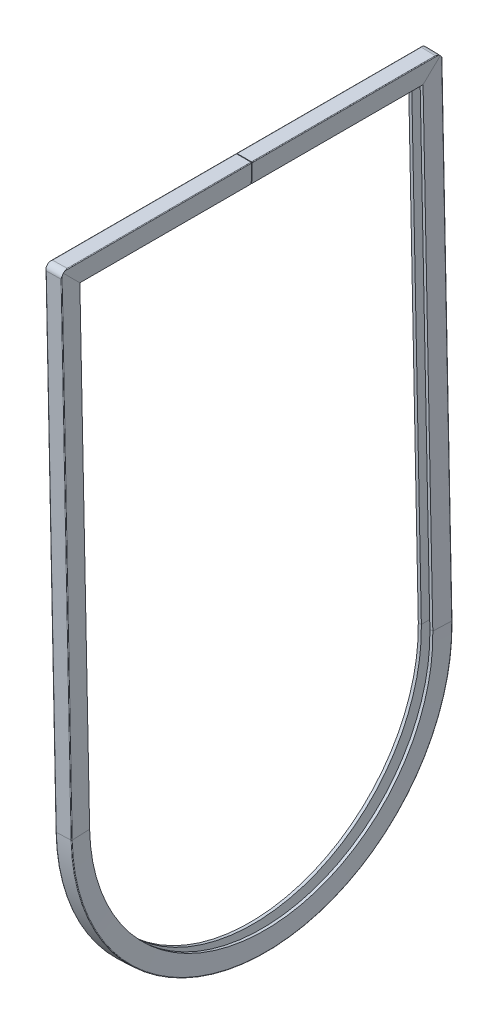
ISO-10303-21;
HEADER;
FILE_DESCRIPTION(('STEP AP214'),'2;1');
FILE_NAME('part.step','',(''),(''),'','','');
FILE_SCHEMA(('AUTOMOTIVE_DESIGN { 1 0 10303 214 1 1 1 1 }'));
ENDSEC;
DATA;
#1=APPLICATION_CONTEXT('core data for automotive mechanical design processes');
#2=APPLICATION_PROTOCOL_DEFINITION('international standard','automotive_design',2000,#1);
#3=PRODUCT_CONTEXT('',#1,'mechanical');
#4=PRODUCT('Part','Part','',(#3));
#5=PRODUCT_RELATED_PRODUCT_CATEGORY('part','',(#4));
#6=PRODUCT_DEFINITION_FORMATION('','',#4);
#7=PRODUCT_DEFINITION_CONTEXT('part definition',#1,'design');
#8=PRODUCT_DEFINITION('design','',#6,#7);
#9=PRODUCT_DEFINITION_SHAPE('','',#8);
#10=(LENGTH_UNIT() NAMED_UNIT(*) SI_UNIT(.MILLI.,.METRE.));
#11=(NAMED_UNIT(*) PLANE_ANGLE_UNIT() SI_UNIT($,.RADIAN.));
#12=(NAMED_UNIT(*) SI_UNIT($,.STERADIAN.) SOLID_ANGLE_UNIT());
#13=UNCERTAINTY_MEASURE_WITH_UNIT(LENGTH_MEASURE(1.E-05),#10,'distance_accuracy_value','');
#14=(GEOMETRIC_REPRESENTATION_CONTEXT(3) GLOBAL_UNCERTAINTY_ASSIGNED_CONTEXT((#13)) GLOBAL_UNIT_ASSIGNED_CONTEXT((#10,
#11,#12)) REPRESENTATION_CONTEXT('',''));
#15=CARTESIAN_POINT('',(0.,0.,0.));
#16=DIRECTION('',(0.,0.,1.));
#17=DIRECTION('',(1.,0.,0.));
#18=AXIS2_PLACEMENT_3D('',#15,#16,#17);
#19=CARTESIAN_POINT('',(1.1218616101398,1.58749999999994,119.11687873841));
#20=DIRECTION('',(-0.999783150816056,0.,0.0208242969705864));
#21=DIRECTION('',(0.0208242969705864,0.,0.999783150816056));
#22=AXIS2_PLACEMENT_3D('',#19,#20,#21);
#23=CYLINDRICAL_SURFACE('',#22,3.175);
#24=DIRECTION('',(-0.999783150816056,0.,0.0208242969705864));
#25=VECTOR('',#24,1.);
#26=CARTESIAN_POINT('',(1.18797874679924,1.58887744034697,122.291189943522));
#27=LINE('',#26,#25);
#28=CARTESIAN_POINT('',(3.71068365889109,1.58887744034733,122.238644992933));
#29=VERTEX_POINT('',#28);
#30=CARTESIAN_POINT('',(-3.57844938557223,1.58887744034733,122.390468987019));
#31=VERTEX_POINT('',#30);
#32=EDGE_CURVE('E709',#29,#31,#27,.T.);
#33=ORIENTED_EDGE('',*,*,#32,.F.);
#34=CARTESIAN_POINT('',(3.99225030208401,2.98625920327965,121.90799044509));
#35=CARTESIAN_POINT('',(3.99317478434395,2.96375552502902,121.919017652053));
#36=CARTESIAN_POINT('',(3.99352432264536,2.94111378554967,121.929792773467));
#37=CARTESIAN_POINT('',(3.99320747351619,2.89560423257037,121.950814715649));
#38=CARTESIAN_POINT('',(3.99254152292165,2.87273652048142,121.961061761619));
#39=CARTESIAN_POINT('',(3.98922599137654,2.80393190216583,121.990948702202));
#40=CARTESIAN_POINT('',(3.98526134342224,2.75770337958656,122.009778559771));
#41=CARTESIAN_POINT('',(3.97464211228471,2.66495816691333,122.045104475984));
#42=CARTESIAN_POINT('',(3.96800123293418,2.61844411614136,122.061611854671));
#43=CARTESIAN_POINT('',(3.95260240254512,2.52501311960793,122.092403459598));
#44=CARTESIAN_POINT('',(3.94384327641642,2.47809596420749,122.106686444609));
#45=CARTESIAN_POINT('',(3.91380770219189,2.33058861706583,122.147971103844));
#46=CARTESIAN_POINT('',(3.88960105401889,2.22947084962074,122.171026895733));
#47=CARTESIAN_POINT('',(3.83695468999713,2.02654524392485,122.207194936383));
#48=CARTESIAN_POINT('',(3.80851130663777,1.92473688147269,122.220298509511));
#49=CARTESIAN_POINT('',(3.75774123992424,1.74847216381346,122.234456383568));
#50=CARTESIAN_POINT('',(3.73584320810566,1.6740724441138,122.23781229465));
#51=CARTESIAN_POINT('',(3.71281226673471,1.596083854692,122.238591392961));
#52=CARTESIAN_POINT('',(3.71174801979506,1.59248062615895,122.238621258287));
#53=CARTESIAN_POINT('',(3.71068365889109,1.58887744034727,122.238644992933));
#54=B_SPLINE_CURVE_WITH_KNOTS('',3,(#34,#35,#36,#37,#38,#39,#40,#41,#42,#43,#44,#45,#46,#47,#48,
#49,#50,#51,#52,#53),.UNSPECIFIED.,.F.,.F.,(4,2,2,2,2,2,2,2,2,4),(0.,0.0752106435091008,
0.150388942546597,0.300445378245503,0.449743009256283,0.599123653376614,0.917913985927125,
1.23698189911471,1.46967283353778,1.48094449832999),.UNSPECIFIED.);
#55=CARTESIAN_POINT('',(3.99225030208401,2.98625920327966,121.90799044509));
#56=VERTEX_POINT('',#55);
#57=EDGE_CURVE('E11',#56,#29,#54,.T.);
#58=ORIENTED_EDGE('',*,*,#57,.F.);
#59=CARTESIAN_POINT('',(3.90260416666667,1.58749999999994,119.058959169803));
#60=DIRECTION('',(0.998915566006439,0.0208107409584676,-0.0416485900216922));
#61=DIRECTION('',(-0.0441718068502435,0.706339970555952,-0.706493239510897));
#62=AXIS2_PLACEMENT_3D('',#59,#60,#61);
#63=ELLIPSE('',#62,3.17637773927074,3.175);
#64=CARTESIAN_POINT('',(3.94938647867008,3.83305097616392,121.30304856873));
#65=VERTEX_POINT('',#64);
#66=EDGE_CURVE('E52',#65,#56,#63,.T.);
#67=ORIENTED_EDGE('',*,*,#66,.F.);
#68=CARTESIAN_POINT('',(3.90260416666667,1.58749999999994,119.058959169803));
#69=DIRECTION('',(0.999783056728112,-0.0208288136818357,0.));
#70=DIRECTION('',(-0.0147281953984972,-0.706953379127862,0.707106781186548));
#71=AXIS2_PLACEMENT_3D('',#68,#69,#70);
#72=ELLIPSE('',#71,3.17637773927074,3.175);
#73=CARTESIAN_POINT('',(3.96199764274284,4.43838685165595,120.455547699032));
#74=VERTEX_POINT('',#73);
#75=EDGE_CURVE('E759',#74,#65,#72,.T.);
#76=ORIENTED_EDGE('',*,*,#75,.F.);
#77=CARTESIAN_POINT('',(3.64456652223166,4.76249999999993,119.064333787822));
#78=CARTESIAN_POINT('',(3.64570593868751,4.76249999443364,119.067913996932));
#79=CARTESIAN_POINT('',(3.64684538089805,4.76249386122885,119.07149427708));
#80=CARTESIAN_POINT('',(3.68018718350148,4.76213502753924,119.176262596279));
#81=CARTESIAN_POINT('',(3.71237143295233,4.7568925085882,119.277500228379));
#82=CARTESIAN_POINT('',(3.77465683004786,4.73648342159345,119.480132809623));
#83=CARTESIAN_POINT('',(3.80474786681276,4.7212719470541,119.581526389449));
#84=CARTESIAN_POINT('',(3.85041106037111,4.68775996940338,119.748354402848));
#85=CARTESIAN_POINT('',(3.86738671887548,4.67238707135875,119.813996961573));
#86=CARTESIAN_POINT('',(3.89833792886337,4.63723829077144,119.944877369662));
#87=CARTESIAN_POINT('',(3.91231176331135,4.61745990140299,120.010114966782));
#88=CARTESIAN_POINT('',(3.93585064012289,4.57372318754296,120.139107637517));
#89=CARTESIAN_POINT('',(3.94546627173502,4.5498175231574,120.202871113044));
#90=CARTESIAN_POINT('',(3.95881691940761,4.49771117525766,120.329269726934));
#91=CARTESIAN_POINT('',(3.96255886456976,4.46951559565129,120.391906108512));
#92=CARTESIAN_POINT('',(3.96177006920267,4.42566467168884,120.481560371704));
#93=CARTESIAN_POINT('',(3.96063821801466,4.41155718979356,120.509372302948));
#94=CARTESIAN_POINT('',(3.95622636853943,4.38264035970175,120.564414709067));
#95=CARTESIAN_POINT('',(3.95294950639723,4.36783206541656,120.591645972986));
#96=CARTESIAN_POINT('',(3.94371087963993,4.33740973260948,120.645769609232));
#97=CARTESIAN_POINT('',(3.93770949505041,4.32178692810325,120.672650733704));
#98=CARTESIAN_POINT('',(3.92617487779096,4.298097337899,120.71216366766));
#99=CARTESIAN_POINT('',(3.92189529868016,4.2901398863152,120.725228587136));
#100=CARTESIAN_POINT('',(3.91237356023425,4.2742039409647,120.751007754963));
#101=CARTESIAN_POINT('',(3.90713044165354,4.26622543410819,120.763721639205));
#102=CARTESIAN_POINT('',(3.90135138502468,4.25827082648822,120.776217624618));
#103=B_SPLINE_CURVE_WITH_KNOTS('',3,(#77,#78,#79,#80,#81,#82,#83,#84,#85,#86,#87,#88,#89,#90,
#91,#92,#93,#94,#95,#96,#97,#98,#99,#100,#101,#102),.UNSPECIFIED.,.F.,.F.,(4,2,2,2,2,2,2,2,2,2,
2,2,4),(0.,0.011271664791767,0.329832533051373,0.649838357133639,0.858237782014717,
1.06675609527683,1.27278774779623,1.47857616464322,1.57212512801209,1.66553762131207,
1.76035432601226,1.80797941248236,1.85565217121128),.UNSPECIFIED.);
#104=CARTESIAN_POINT('',(3.64456652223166,4.76249999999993,119.064333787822));
#105=VERTEX_POINT('',#104);
#106=EDGE_CURVE('E751',#105,#74,#103,.T.);
#107=ORIENTED_EDGE('',*,*,#106,.F.);
#108=DIRECTION('',(-0.999783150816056,0.,0.0208242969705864));
#109=VECTOR('',#108,1.);
#110=CARTESIAN_POINT('',(-4.04029370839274,4.76249999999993,119.224400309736));
#111=LINE('',#110,#109);
#112=CARTESIAN_POINT('',(-3.64456652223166,4.76249999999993,119.216157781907));
#113=VERTEX_POINT('',#112);
#114=EDGE_CURVE('E746',#113,#105,#111,.F.);
#115=ORIENTED_EDGE('',*,*,#114,.F.);
#116=CARTESIAN_POINT('',(-3.96199764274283,4.43838685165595,120.62059512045));
#117=CARTESIAN_POINT('',(-3.96222296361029,4.44941313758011,120.598102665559));
#118=CARTESIAN_POINT('',(-3.96187721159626,4.46016637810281,120.575479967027));
#119=CARTESIAN_POINT('',(-3.96018217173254,4.48110982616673,120.530023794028));
#120=CARTESIAN_POINT('',(-3.95883332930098,4.49130028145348,120.507190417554));
#121=CARTESIAN_POINT('',(-3.95349658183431,4.52097615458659,120.438511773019));
#122=CARTESIAN_POINT('',(-3.94821824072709,4.53961095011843,120.392396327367));
#123=CARTESIAN_POINT('',(-3.93505855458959,4.57448325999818,120.299926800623));
#124=CARTESIAN_POINT('',(-3.92719059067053,4.59073248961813,120.253575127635));
#125=CARTESIAN_POINT('',(-3.90941729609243,4.62097591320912,120.160507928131));
#126=CARTESIAN_POINT('',(-3.8995107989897,4.63496880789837,120.113792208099));
#127=CARTESIAN_POINT('',(-3.86561404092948,4.67579775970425,119.965274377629));
#128=CARTESIAN_POINT('',(-3.83870864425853,4.69850136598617,119.862981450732));
#129=CARTESIAN_POINT('',(-3.78085365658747,4.73375457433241,119.657768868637));
#130=CARTESIAN_POINT('',(-3.7499002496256,4.74629451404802,119.554848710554));
#131=CARTESIAN_POINT('',(-3.69502891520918,4.75936154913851,119.376884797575));
#132=CARTESIAN_POINT('',(-3.6714933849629,4.76223154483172,119.301890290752));
#133=CARTESIAN_POINT('',(-3.64681826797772,4.76249400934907,119.223326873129));
#134=CARTESIAN_POINT('',(-3.6456923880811,4.76249999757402,119.219742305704));
#135=CARTESIAN_POINT('',(-3.64456652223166,4.76249999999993,119.216157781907));
#136=B_SPLINE_CURVE_WITH_KNOTS('',3,(#116,#117,#118,#119,#120,#121,#122,#123,#124,#125,#126,
#127,#128,#129,#130,#131,#132,#133,#134,#135),.UNSPECIFIED.,.F.,.F.,(4,2,2,2,2,2,2,2,2,4),(0.,
0.0751306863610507,0.150228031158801,0.30011762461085,0.449244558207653,0.598457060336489,
0.922278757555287,1.24640794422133,1.48217629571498,1.49344795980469),.UNSPECIFIED.);
#137=CARTESIAN_POINT('',(-3.96199764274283,4.43838685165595,120.62059512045));
#138=VERTEX_POINT('',#137);
#139=EDGE_CURVE('E738',#138,#113,#136,.T.);
#140=ORIENTED_EDGE('',*,*,#139,.F.);
#141=CARTESIAN_POINT('',(-3.90260416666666,1.58749999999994,119.221532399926));
#142=DIRECTION('',(-0.999783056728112,-0.0208288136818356,0.));
#143=DIRECTION('',(-0.0147281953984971,0.70695337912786,0.70710678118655));
#144=AXIS2_PLACEMENT_3D('',#141,#142,#143);
#145=ELLIPSE('',#144,3.17637773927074,3.175);
#146=CARTESIAN_POINT('',(-3.94938647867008,3.83305097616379,121.467570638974));
#147=VERTEX_POINT('',#146);
#148=EDGE_CURVE('E747',#147,#138,#145,.T.);
#149=ORIENTED_EDGE('',*,*,#148,.F.);
#150=CARTESIAN_POINT('',(-3.90260416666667,1.58749999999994,119.221532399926));
#151=DIRECTION('',(-0.999783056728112,-0.0208288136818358,0.));
#152=DIRECTION('',(-0.0147281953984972,0.706953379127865,0.707106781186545));
#153=AXIS2_PLACEMENT_3D('',#150,#151,#152);
#154=ELLIPSE('',#153,3.17637773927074,3.175);
#155=CARTESIAN_POINT('',(-3.93174498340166,2.98625920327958,122.073037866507));
#156=VERTEX_POINT('',#155);
#157=EDGE_CURVE('E722',#156,#147,#154,.T.);
#158=ORIENTED_EDGE('',*,*,#157,.F.);
#159=CARTESIAN_POINT('',(-3.57844938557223,1.58887744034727,122.390468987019));
#160=CARTESIAN_POINT('',(-3.57964941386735,1.59243771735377,122.390492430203));
#161=CARTESIAN_POINT('',(-3.58084959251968,1.59599805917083,122.390509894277));
#162=CARTESIAN_POINT('',(-3.61603709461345,1.70037475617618,122.390846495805));
#163=CARTESIAN_POINT('',(-3.650107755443,1.80123687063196,122.386375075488));
#164=CARTESIAN_POINT('',(-3.71632067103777,2.00272454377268,122.367695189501));
#165=CARTESIAN_POINT('',(-3.74846254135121,2.10335005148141,122.353484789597));
#166=CARTESIAN_POINT('',(-3.79811757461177,2.26982542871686,122.32157727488));
#167=CARTESIAN_POINT('',(-3.81688515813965,2.33584930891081,122.306715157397));
#168=CARTESIAN_POINT('',(-3.85154407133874,2.46746574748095,122.272509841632));
#169=CARTESIAN_POINT('',(-3.86743772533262,2.53305861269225,122.253170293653));
#170=CARTESIAN_POINT('',(-3.8882270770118,2.63120033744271,122.220636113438));
#171=CARTESIAN_POINT('',(-3.89466690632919,2.66399701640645,122.20915352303));
#172=CARTESIAN_POINT('',(-3.90627676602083,2.72937610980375,122.185013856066));
#173=CARTESIAN_POINT('',(-3.91144714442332,2.76195858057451,122.172357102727));
#174=CARTESIAN_POINT('',(-3.92027972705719,2.82696463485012,122.14581877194));
#175=CARTESIAN_POINT('',(-3.92393682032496,2.85938732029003,122.131933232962));
#176=CARTESIAN_POINT('',(-3.92936442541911,2.92389516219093,122.102979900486));
#177=CARTESIAN_POINT('',(-3.93113309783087,2.95597995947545,122.087910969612));
#178=CARTESIAN_POINT('',(-3.93177677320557,2.98783004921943,122.072266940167));
#179=B_SPLINE_CURVE_WITH_KNOTS('',3,(#159,#160,#161,#162,#163,#164,#165,#166,#167,#168,#169,
#170,#171,#172,#173,#174,#175,#176,#177,#178),.UNSPECIFIED.,.F.,.F.,(4,2,2,2,2,2,2,2,2,4),(0.,
0.011271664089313,0.330440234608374,0.649672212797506,0.860200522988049,1.07055779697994,
1.17654428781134,1.28250168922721,1.38881408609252,1.49522994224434),.UNSPECIFIED.);
#180=EDGE_CURVE('E714',#31,#156,#179,.T.);
#181=ORIENTED_EDGE('',*,*,#180,.F.);
#182=EDGE_LOOP('',(#33,#58,#67,#76,#107,#115,#140,#149,#158,#181));
#183=FACE_BOUND('',#182,.T.);
#184=ADVANCED_FACE('F38',(#183),#23,.T.);
#185=CARTESIAN_POINT('',(-4.04029370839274,1.5875,-68.1704003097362));
#186=DIRECTION('',(-0.999783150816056,0.,-0.0208242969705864));
#187=DIRECTION('',(-0.0208242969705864,0.,0.999783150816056));
#188=AXIS2_PLACEMENT_3D('',#185,#186,#187);
#189=CYLINDRICAL_SURFACE('',#188,3.175);
#190=DIRECTION('',(0.999783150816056,0.,0.0208242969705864));
#191=VECTOR('',#190,1.);
#192=CARTESIAN_POINT('',(-3.97417657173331,1.58887744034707,-71.344711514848));
#193=LINE('',#192,#191);
#194=CARTESIAN_POINT('',(-3.57844938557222,1.58887744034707,-71.3364689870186));
#195=VERTEX_POINT('',#194);
#196=CARTESIAN_POINT('',(3.71068365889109,1.58887744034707,-71.1846449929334));
#197=VERTEX_POINT('',#196);
#198=EDGE_CURVE('E623',#195,#197,#193,.T.);
#199=ORIENTED_EDGE('',*,*,#198,.F.);
#200=CARTESIAN_POINT('',(-3.93174498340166,2.98625920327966,-71.0190378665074));
#201=CARTESIAN_POINT('',(-3.93127210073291,2.96377171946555,-71.0300664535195));
#202=CARTESIAN_POINT('',(-3.93023136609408,2.94116579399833,-71.0408101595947));
#203=CARTESIAN_POINT('',(-3.92715413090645,2.89576386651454,-71.061713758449));
#204=CARTESIAN_POINT('',(-3.92511807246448,2.87296795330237,-71.0718739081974));
#205=CARTESIAN_POINT('',(-3.91773516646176,2.80442821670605,-71.1014321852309));
#206=CARTESIAN_POINT('',(-3.91111052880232,2.75844077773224,-71.1199529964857));
#207=CARTESIAN_POINT('',(-3.89530433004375,2.66628048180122,-71.1545436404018));
#208=CARTESIAN_POINT('',(-3.88613595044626,2.62010975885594,-71.1706254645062));
#209=CARTESIAN_POINT('',(-3.86580208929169,2.52744598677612,-71.2004921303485));
#210=CARTESIAN_POINT('',(-3.85463546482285,2.48095276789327,-71.214275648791));
#211=CARTESIAN_POINT('',(-3.81680972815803,2.33319074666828,-71.2543897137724));
#212=CARTESIAN_POINT('',(-3.78731257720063,2.23149014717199,-71.2765279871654));
#213=CARTESIAN_POINT('',(-3.72447423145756,2.02754216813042,-71.3105684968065));
#214=CARTESIAN_POINT('',(-3.69112941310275,1.92529436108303,-71.3224609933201));
#215=CARTESIAN_POINT('',(-3.63230299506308,1.74851738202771,-71.3343822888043));
#216=CARTESIAN_POINT('',(-3.60715586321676,1.67403050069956,-71.3367614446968));
#217=CARTESIAN_POINT('',(-3.58084960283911,1.59599808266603,-71.33650989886));
#218=CARTESIAN_POINT('',(-3.57964942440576,1.59243774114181,-71.3364924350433));
#219=CARTESIAN_POINT('',(-3.57844938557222,1.58887744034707,-71.3364689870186));
#220=B_SPLINE_CURVE_WITH_KNOTS('',3,(#200,#201,#202,#203,#204,#205,#206,#207,#208,#209,#210,
#211,#212,#213,#214,#215,#216,#217,#218,#219),.UNSPECIFIED.,.F.,.F.,(4,2,2,2,2,2,2,2,2,4),(0.,
0.0751306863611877,0.150228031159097,0.300117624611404,0.449244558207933,0.598457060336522,
0.922278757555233,1.24640794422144,1.48217629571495,1.49344795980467),.UNSPECIFIED.);
#221=CARTESIAN_POINT('',(-3.93174498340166,2.98625920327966,-71.0190378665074));
#222=VERTEX_POINT('',#221);
#223=EDGE_CURVE('E702',#222,#195,#220,.T.);
#224=ORIENTED_EDGE('',*,*,#223,.F.);
#225=CARTESIAN_POINT('',(-3.90260416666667,1.5875,-68.1675323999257));
#226=DIRECTION('',(-0.999783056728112,-0.0208288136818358,0.));
#227=DIRECTION('',(-0.0147281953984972,0.706953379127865,-0.707106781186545));
#228=AXIS2_PLACEMENT_3D('',#225,#226,#227);
#229=ELLIPSE('',#228,3.17637773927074,3.175);
#230=CARTESIAN_POINT('',(-3.94938647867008,3.83305097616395,-70.4135706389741));
#231=VERTEX_POINT('',#230);
#232=EDGE_CURVE('E710',#231,#222,#229,.T.);
#233=ORIENTED_EDGE('',*,*,#232,.F.);
#234=CARTESIAN_POINT('',(-3.90260416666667,1.5875,-68.1675323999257));
#235=DIRECTION('',(0.999783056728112,0.0208288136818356,0.));
#236=DIRECTION('',(-0.0147281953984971,0.70695337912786,-0.70710678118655));
#237=AXIS2_PLACEMENT_3D('',#234,#235,#236);
#238=ELLIPSE('',#237,3.17637773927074,3.175);
#239=CARTESIAN_POINT('',(-3.96199764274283,4.43838685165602,-69.5665951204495));
#240=VERTEX_POINT('',#239);
#241=EDGE_CURVE('E280',#240,#231,#238,.F.);
#242=ORIENTED_EDGE('',*,*,#241,.F.);
#243=CARTESIAN_POINT('',(-3.64456652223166,4.7625,-68.1621577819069));
#244=CARTESIAN_POINT('',(-3.64569237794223,4.76249999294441,-68.165742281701));
#245=CARTESIAN_POINT('',(-3.64681825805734,4.76249400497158,-68.1693268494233));
#246=CARTESIAN_POINT('',(-3.67982393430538,4.76214306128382,-68.2744138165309));
#247=CARTESIAN_POINT('',(-3.71168629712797,4.75700687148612,-68.3759637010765));
#248=CARTESIAN_POINT('',(-3.77328556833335,4.73703961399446,-68.5787867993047));
#249=CARTESIAN_POINT('',(-3.80302205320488,4.72220662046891,-68.6800599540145));
#250=CARTESIAN_POINT('',(-3.84852421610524,4.68934422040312,-68.8475334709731));
#251=CARTESIAN_POINT('',(-3.86559919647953,4.67412314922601,-68.9139339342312));
#252=CARTESIAN_POINT('',(-3.89678979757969,4.63926060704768,-69.0462437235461));
#253=CARTESIAN_POINT('',(-3.91090781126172,4.61962273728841,-69.1121534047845));
#254=CARTESIAN_POINT('',(-3.92896676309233,4.58670526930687,-69.2107068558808));
#255=CARTESIAN_POINT('',(-3.93448166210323,4.5751052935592,-69.2436305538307));
#256=CARTESIAN_POINT('',(-3.94422221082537,4.55075746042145,-69.3092372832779));
#257=CARTESIAN_POINT('',(-3.94844821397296,4.53800991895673,-69.3419203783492));
#258=CARTESIAN_POINT('',(-3.95537049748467,4.51132161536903,-69.4070963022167));
#259=CARTESIAN_POINT('',(-3.95806160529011,4.4973769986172,-69.4395881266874));
#260=CARTESIAN_POINT('',(-3.96154046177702,4.46834490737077,-69.5041950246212));
#261=CARTESIAN_POINT('',(-3.96232635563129,4.45325633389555,-69.5363097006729));
#262=CARTESIAN_POINT('',(-3.9619806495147,4.43761611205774,-69.5681662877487));
#263=B_SPLINE_CURVE_WITH_KNOTS('',3,(#243,#244,#245,#246,#247,#248,#249,#250,#251,#252,#253,
#254,#255,#256,#257,#258,#259,#260,#261,#262),.UNSPECIFIED.,.F.,.F.,(4,2,2,2,2,2,2,2,2,4),(0.,
0.0112716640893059,0.330440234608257,0.649672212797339,0.860200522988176,1.07055779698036,
1.17654428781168,1.28250168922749,1.38881408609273,1.49522994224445),.UNSPECIFIED.);
#264=CARTESIAN_POINT('',(-3.64456652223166,4.7625,-68.1621577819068));
#265=VERTEX_POINT('',#264);
#266=EDGE_CURVE('E677',#265,#240,#263,.T.);
#267=ORIENTED_EDGE('',*,*,#266,.F.);
#268=DIRECTION('',(0.999783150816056,0.,0.0208242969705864));
#269=VECTOR('',#268,1.);
#270=CARTESIAN_POINT('',(-4.04029370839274,4.7625,-68.1704003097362));
#271=LINE('',#270,#269);
#272=CARTESIAN_POINT('',(3.64456652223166,4.7625,-68.0103337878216));
#273=VERTEX_POINT('',#272);
#274=EDGE_CURVE('E686',#273,#265,#271,.F.);
#275=ORIENTED_EDGE('',*,*,#274,.F.);
#276=CARTESIAN_POINT('',(3.96199764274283,4.43838685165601,-69.4015476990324));
#277=CARTESIAN_POINT('',(3.9622234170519,4.44942115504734,-69.3790296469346));
#278=CARTESIAN_POINT('',(3.96187687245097,4.4601913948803,-69.3563855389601));
#279=CARTESIAN_POINT('',(3.96017459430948,4.48118243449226,-69.3108924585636));
#280=CARTESIAN_POINT('',(3.95881929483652,4.49140346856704,-69.2880435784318));
#281=CARTESIAN_POINT('',(3.95344988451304,4.52118503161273,-69.2193229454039));
#282=CARTESIAN_POINT('',(3.9481320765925,4.53990818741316,-69.1731870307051));
#283=CARTESIAN_POINT('',(3.93485030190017,4.57496506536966,-69.0806831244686));
#284=CARTESIAN_POINT('',(3.92689985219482,4.59131039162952,-69.0343174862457));
#285=CARTESIAN_POINT('',(3.90892071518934,4.62173411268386,-68.9412274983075));
#286=CARTESIAN_POINT('',(3.89889087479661,4.63581124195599,-68.8945029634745));
#287=CARTESIAN_POINT('',(3.8649366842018,4.67639748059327,-68.7476532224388));
#288=CARTESIAN_POINT('',(3.83815460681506,4.69890031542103,-68.6470615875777));
#289=CARTESIAN_POINT('',(3.78055196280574,4.73387614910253,-68.4452765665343));
#290=CARTESIAN_POINT('',(3.74972790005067,4.74634039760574,-68.3440827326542));
#291=CARTESIAN_POINT('',(3.69501437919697,4.75936147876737,-68.1689137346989));
#292=CARTESIAN_POINT('',(3.67150662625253,4.762228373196,-68.0949862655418));
#293=CARTESIAN_POINT('',(3.64684539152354,4.7624938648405,-68.017494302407));
#294=CARTESIAN_POINT('',(3.64570594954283,4.76249999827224,-68.0139140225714));
#295=CARTESIAN_POINT('',(3.64456652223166,4.7625,-68.0103337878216));
#296=B_SPLINE_CURVE_WITH_KNOTS('',3,(#276,#277,#278,#279,#280,#281,#282,#283,#284,#285,#286,
#287,#288,#289,#290,#291,#292,#293,#294,#295),.UNSPECIFIED.,.F.,.F.,(4,2,2,2,2,2,2,2,2,4),(0.,
0.0752106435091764,0.150388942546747,0.300445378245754,0.449743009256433,0.599123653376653,
0.917913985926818,1.23698189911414,1.46967283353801,1.48094449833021),.UNSPECIFIED.);
#297=CARTESIAN_POINT('',(3.96199764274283,4.43838685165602,-69.4015476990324));
#298=VERTEX_POINT('',#297);
#299=EDGE_CURVE('E670',#298,#273,#296,.T.);
#300=ORIENTED_EDGE('',*,*,#299,.F.);
#301=CARTESIAN_POINT('',(3.90260416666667,1.5875,-68.0049591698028));
#302=DIRECTION('',(-0.999783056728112,0.0208288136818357,0.));
#303=DIRECTION('',(-0.0147281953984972,-0.706953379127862,-0.707106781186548));
#304=AXIS2_PLACEMENT_3D('',#301,#302,#303);
#305=ELLIPSE('',#304,3.17637773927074,3.175);
#306=CARTESIAN_POINT('',(3.94938647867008,3.83305097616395,-70.2490485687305));
#307=VERTEX_POINT('',#306);
#308=EDGE_CURVE('E903',#307,#298,#305,.F.);
#309=ORIENTED_EDGE('',*,*,#308,.F.);
#310=CARTESIAN_POINT('',(3.90260416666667,1.5875,-68.0049591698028));
#311=DIRECTION('',(0.998915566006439,0.0208107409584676,0.0416485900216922));
#312=DIRECTION('',(-0.0441718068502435,0.706339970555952,0.706493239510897));
#313=AXIS2_PLACEMENT_3D('',#310,#311,#312);
#314=ELLIPSE('',#313,3.17637773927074,3.175);
#315=CARTESIAN_POINT('',(3.99225030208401,2.98625920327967,-70.8539904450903));
#316=VERTEX_POINT('',#315);
#317=EDGE_CURVE('E651',#316,#307,#314,.T.);
#318=ORIENTED_EDGE('',*,*,#317,.F.);
#319=CARTESIAN_POINT('',(3.7106836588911,1.58887744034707,-71.1846449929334));
#320=CARTESIAN_POINT('',(3.71174800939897,1.59248060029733,-71.1846212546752));
#321=CARTESIAN_POINT('',(3.71281225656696,1.59608382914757,-71.1845913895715));
#322=CARTESIAN_POINT('',(3.7439499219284,1.70152358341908,-71.1835381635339));
#323=CARTESIAN_POINT('',(3.7739023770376,1.80340719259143,-71.177626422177));
#324=CARTESIAN_POINT('',(3.83151515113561,2.00728400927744,-71.1559244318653));
#325=CARTESIAN_POINT('',(3.8591644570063,2.10927561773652,-71.1400894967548));
#326=CARTESIAN_POINT('',(3.90063514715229,2.27700380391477,-71.1056336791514));
#327=CARTESIAN_POINT('',(3.91591605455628,2.34297895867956,-71.0899105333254));
#328=CARTESIAN_POINT('',(3.94339580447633,2.47446026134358,-71.0541247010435));
#329=CARTESIAN_POINT('',(3.95559288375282,2.53996612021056,-71.0340595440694));
#330=CARTESIAN_POINT('',(3.97552399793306,2.66940201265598,-70.9898420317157));
#331=CARTESIAN_POINT('',(3.9833095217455,2.73334152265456,-70.965741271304));
#332=CARTESIAN_POINT('',(3.99293656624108,2.85996812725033,-70.9133681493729));
#333=CARTESIAN_POINT('',(3.99478509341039,2.9226566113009,-70.8851007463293));
#334=CARTESIAN_POINT('',(3.99121608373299,3.01225597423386,-70.8412757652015));
#335=CARTESIAN_POINT('',(3.98921165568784,3.04003218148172,-70.827194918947));
#336=CARTESIAN_POINT('',(3.98305307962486,3.0949582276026,-70.7983762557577));
#337=CARTESIAN_POINT('',(3.97890207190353,3.12210892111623,-70.7836394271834));
#338=CARTESIAN_POINT('',(3.96790659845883,3.17601522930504,-70.7534161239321));
#339=CARTESIAN_POINT('',(3.96102258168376,3.20275876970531,-70.7379217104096));
#340=CARTESIAN_POINT('',(3.94817664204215,3.2420126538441,-70.7144775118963));
#341=CARTESIAN_POINT('',(3.94346108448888,3.2549821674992,-70.706610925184));
#342=CARTESIAN_POINT('',(3.9330746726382,3.28055054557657,-70.6908767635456));
#343=CARTESIAN_POINT('',(3.92740286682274,3.29314902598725,-70.6830091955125));
#344=CARTESIAN_POINT('',(3.92120039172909,3.30551850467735,-70.6751766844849));
#345=B_SPLINE_CURVE_WITH_KNOTS('',3,(#319,#320,#321,#322,#323,#324,#325,#326,#327,#328,#329,
#330,#331,#332,#333,#334,#335,#336,#337,#338,#339,#340,#341,#342,#343,#344),.UNSPECIFIED.,.F.,
.F.,(4,2,2,2,2,2,2,2,2,2,2,2,4),(0.,0.0112716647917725,0.329832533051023,0.649838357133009,
0.858237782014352,1.0667560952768,1.27278774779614,1.47857616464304,1.57212512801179,
1.66553762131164,1.76035432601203,1.80797941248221,1.85565217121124),.UNSPECIFIED.);
#346=EDGE_CURVE('E642',#197,#316,#345,.T.);
#347=ORIENTED_EDGE('',*,*,#346,.F.);
#348=EDGE_LOOP('',(#199,#224,#233,#242,#267,#275,#300,#309,#318,#347));
#349=FACE_BOUND('',#348,.T.);
#350=ADVANCED_FACE('F657',(#349),#189,.T.);
#351=CARTESIAN_POINT('',(3.7703125,-4.7625,25.4));
#352=DIRECTION('',(-0.999783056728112,0.0208288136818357,0.));
#353=DIRECTION('',(-0.0208288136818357,-0.999783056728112,0.));
#354=AXIS2_PLACEMENT_3D('',#351,#352,#353);
#355=PLANE('',#354);
#356=DIRECTION('',(0.0147345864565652,0.707260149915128,-0.706799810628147));
#357=VECTOR('',#356,1.);
#358=CARTESIAN_POINT('',(3.22747474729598,-30.8187121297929,-35.619839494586));
#359=LINE('',#358,#357);
#360=CARTESIAN_POINT('',(3.7703125,-4.76250000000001,-61.6590922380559));
#361=VERTEX_POINT('',#360);
#362=EDGE_CURVE('E510',#361,#307,#359,.T.);
#363=ORIENTED_EDGE('',*,*,#362,.T.);
#364=ORIENTED_EDGE('',*,*,#308,.T.);
#365=DIRECTION('',(0.,0.,-1.));
#366=VECTOR('',#365,1.);
#367=CARTESIAN_POINT('',(3.96199764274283,4.43838685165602,25.4));
#368=LINE('',#367,#366);
#369=CARTESIAN_POINT('',(3.96199764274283,4.43838685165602,25.4));
#370=VERTEX_POINT('',#369);
#371=EDGE_CURVE('E560',#298,#370,#368,.F.);
#372=ORIENTED_EDGE('',*,*,#371,.T.);
#373=DIRECTION('',(0.0208288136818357,0.999783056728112,0.));
#374=VECTOR('',#373,1.);
#375=CARTESIAN_POINT('',(3.7703125,-4.7625,25.4));
#376=LINE('',#375,#374);
#377=CARTESIAN_POINT('',(3.7703125,-4.7625,25.4));
#378=VERTEX_POINT('',#377);
#379=EDGE_CURVE('E505',#378,#370,#376,.T.);
#380=ORIENTED_EDGE('',*,*,#379,.F.);
#381=DIRECTION('',(0.,0.,-1.));
#382=VECTOR('',#381,1.);
#383=CARTESIAN_POINT('',(3.7703125,-4.7625,25.4));
#384=LINE('',#383,#382);
#385=EDGE_CURVE('E531',#378,#361,#384,.T.);
#386=ORIENTED_EDGE('',*,*,#385,.T.);
#387=EDGE_LOOP('',(#363,#364,#372,#380,#386));
#388=FACE_BOUND('',#387,.T.);
#389=ADVANCED_FACE('F661',(#388),#355,.F.);
#390=CARTESIAN_POINT('',(3.96875,4.7625,25.4));
#391=DIRECTION('',(0.,-1.,0.));
#392=DIRECTION('',(0.,0.,-1.));
#393=AXIS2_PLACEMENT_3D('',#390,#391,#392);
#394=PLANE('',#393);
#395=DIRECTION('',(0.,0.,-1.));
#396=VECTOR('',#395,1.);
#397=CARTESIAN_POINT('',(3.64456652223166,4.7625,25.4));
#398=LINE('',#397,#396);
#399=CARTESIAN_POINT('',(3.64456652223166,4.7625,25.4));
#400=VERTEX_POINT('',#399);
#401=EDGE_CURVE('E547',#400,#273,#398,.T.);
#402=ORIENTED_EDGE('',*,*,#401,.T.);
#403=ORIENTED_EDGE('',*,*,#274,.T.);
#404=DIRECTION('',(0.,0.,-1.));
#405=VECTOR('',#404,1.);
#406=CARTESIAN_POINT('',(-3.64456652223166,4.7625,25.4));
#407=LINE('',#406,#405);
#408=CARTESIAN_POINT('',(-3.64456652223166,4.7625,25.4));
#409=VERTEX_POINT('',#408);
#410=EDGE_CURVE('E551',#265,#409,#407,.F.);
#411=ORIENTED_EDGE('',*,*,#410,.T.);
#412=DIRECTION('',(-1.,0.,0.));
#413=VECTOR('',#412,1.);
#414=CARTESIAN_POINT('',(3.96875,4.7625,25.4));
#415=LINE('',#414,#413);
#416=EDGE_CURVE('E509',#400,#409,#415,.T.);
#417=ORIENTED_EDGE('',*,*,#416,.F.);
#418=EDGE_LOOP('',(#402,#403,#411,#417));
#419=FACE_BOUND('',#418,.T.);
#420=ADVANCED_FACE('F916',(#419),#394,.F.);
#421=CARTESIAN_POINT('',(-3.96875,4.7625,25.4));
#422=DIRECTION('',(0.999783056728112,0.0208288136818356,0.));
#423=DIRECTION('',(-0.0208288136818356,0.999783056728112,0.));
#424=AXIS2_PLACEMENT_3D('',#421,#422,#423);
#425=PLANE('',#424);
#426=DIRECTION('',(0.,0.,-1.));
#427=VECTOR('',#426,1.);
#428=CARTESIAN_POINT('',(-3.96199764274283,4.43838685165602,25.4));
#429=LINE('',#428,#427);
#430=CARTESIAN_POINT('',(-3.96199764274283,4.43838685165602,25.4));
#431=VERTEX_POINT('',#430);
#432=EDGE_CURVE('E295',#431,#240,#429,.T.);
#433=ORIENTED_EDGE('',*,*,#432,.T.);
#434=ORIENTED_EDGE('',*,*,#241,.T.);
#435=DIRECTION('',(0.0147281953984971,-0.706953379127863,0.707106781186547));
#436=VECTOR('',#435,1.);
#437=CARTESIAN_POINT('',(-3.12653391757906,-35.6638719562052,-30.9080772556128));
#438=LINE('',#437,#436);
#439=CARTESIAN_POINT('',(-3.7703125,-4.76250000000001,-61.8161545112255));
#440=VERTEX_POINT('',#439);
#441=EDGE_CURVE('E273',#231,#440,#438,.T.);
#442=ORIENTED_EDGE('',*,*,#441,.T.);
#443=DIRECTION('',(0.,0.,-1.));
#444=VECTOR('',#443,1.);
#445=CARTESIAN_POINT('',(-3.7703125,-4.7625,25.4));
#446=LINE('',#445,#444);
#447=CARTESIAN_POINT('',(-3.7703125,-4.7625,25.4));
#448=VERTEX_POINT('',#447);
#449=EDGE_CURVE('E278',#448,#440,#446,.T.);
#450=ORIENTED_EDGE('',*,*,#449,.F.);
#451=DIRECTION('',(0.0208288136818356,-0.999783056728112,0.));
#452=VECTOR('',#451,1.);
#453=CARTESIAN_POINT('',(-3.96875,4.7625,25.4));
#454=LINE('',#453,#452);
#455=EDGE_CURVE('E514',#431,#448,#454,.T.);
#456=ORIENTED_EDGE('',*,*,#455,.F.);
#457=EDGE_LOOP('',(#433,#434,#442,#450,#456));
#458=FACE_BOUND('',#457,.T.);
#459=ADVANCED_FACE('F276',(#458),#425,.F.);
#460=CARTESIAN_POINT('',(-3.7703125,-4.7625,25.4));
#461=DIRECTION('',(-0.0208288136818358,0.999783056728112,0.));
#462=DIRECTION('',(-0.999783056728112,-0.0208288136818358,0.));
#463=AXIS2_PLACEMENT_3D('',#460,#461,#462);
#464=PLANE('',#463);
#465=ORIENTED_EDGE('',*,*,#449,.T.);
#466=DIRECTION('',(0.999783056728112,0.0208288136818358,0.));
#467=VECTOR('',#466,1.);
#468=CARTESIAN_POINT('',(-2.21655978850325,-4.73013015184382,-61.8161545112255));
#469=LINE('',#468,#467);
#470=CARTESIAN_POINT('',(-2.21655978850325,-4.73013015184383,-61.8161545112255));
#471=VERTEX_POINT('',#470);
#472=EDGE_CURVE('E285',#440,#471,#469,.T.);
#473=ORIENTED_EDGE('',*,*,#472,.T.);
#474=DIRECTION('',(0.,0.,-1.));
#475=VECTOR('',#474,1.);
#476=CARTESIAN_POINT('',(-2.21655978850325,-4.73013015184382,25.4));
#477=LINE('',#476,#475);
#478=CARTESIAN_POINT('',(-2.21655978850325,-4.73013015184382,25.4));
#479=VERTEX_POINT('',#478);
#480=EDGE_CURVE('E296',#479,#471,#477,.T.);
#481=ORIENTED_EDGE('',*,*,#480,.F.);
#482=DIRECTION('',(0.999783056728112,0.0208288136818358,0.));
#483=VECTOR('',#482,1.);
#484=CARTESIAN_POINT('',(-3.7703125,-4.7625,25.4));
#485=LINE('',#484,#483);
#486=EDGE_CURVE('E293',#448,#479,#485,.T.);
#487=ORIENTED_EDGE('',*,*,#486,.F.);
#488=EDGE_LOOP('',(#465,#473,#481,#487));
#489=FACE_BOUND('',#488,.T.);
#490=ADVANCED_FACE('F291',(#489),#464,.F.);
#491=CARTESIAN_POINT('',(-2.21655978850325,-4.73013015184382,25.4));
#492=DIRECTION('',(-0.999783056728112,-0.0208288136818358,0.));
#493=DIRECTION('',(0.0208288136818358,-0.999783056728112,0.));
#494=AXIS2_PLACEMENT_3D('',#491,#492,#493);
#495=PLANE('',#494);
#496=ORIENTED_EDGE('',*,*,#480,.T.);
#497=DIRECTION('',(-0.0147281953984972,0.706953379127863,-0.707106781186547));
#498=VECTOR('',#497,1.);
#499=CARTESIAN_POINT('',(-1.65512631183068,-31.6789370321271,-34.8615));
#500=LINE('',#499,#498);
#501=CARTESIAN_POINT('',(-2.38125,3.17499999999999,-69.723));
#502=VERTEX_POINT('',#501);
#503=EDGE_CURVE('E306',#471,#502,#500,.T.);
#504=ORIENTED_EDGE('',*,*,#503,.T.);
#505=DIRECTION('',(0.,0.,-1.));
#506=VECTOR('',#505,1.);
#507=CARTESIAN_POINT('',(-2.38125,3.175,25.4));
#508=LINE('',#507,#506);
#509=CARTESIAN_POINT('',(-2.38125,3.175,25.4));
#510=VERTEX_POINT('',#509);
#511=EDGE_CURVE('E540',#510,#502,#508,.T.);
#512=ORIENTED_EDGE('',*,*,#511,.F.);
#513=DIRECTION('',(-0.0208288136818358,0.999783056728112,0.));
#514=VECTOR('',#513,1.);
#515=CARTESIAN_POINT('',(-2.21655978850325,-4.73013015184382,25.4));
#516=LINE('',#515,#514);
#517=EDGE_CURVE('E519',#479,#510,#516,.T.);
#518=ORIENTED_EDGE('',*,*,#517,.F.);
#519=EDGE_LOOP('',(#496,#504,#512,#518));
#520=FACE_BOUND('',#519,.T.);
#521=ADVANCED_FACE('F942',(#520),#495,.F.);
#522=CARTESIAN_POINT('',(-2.38125,3.175,25.4));
#523=DIRECTION('',(0.,1.,0.));
#524=DIRECTION('',(0.,0.,1.));
#525=AXIS2_PLACEMENT_3D('',#522,#523,#524);
#526=PLANE('',#525);
#527=ORIENTED_EDGE('',*,*,#511,.T.);
#528=DIRECTION('',(0.999783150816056,0.,0.0208242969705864));
#529=VECTOR('',#528,1.);
#530=CARTESIAN_POINT('',(3.83080234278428,3.175,-69.5936103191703));
#531=LINE('',#530,#529);
#532=CARTESIAN_POINT('',(2.38125,3.17499999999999,-69.6238027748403));
#533=VERTEX_POINT('',#532);
#534=EDGE_CURVE('E827',#502,#533,#531,.T.);
#535=ORIENTED_EDGE('',*,*,#534,.T.);
#536=DIRECTION('',(0.,0.,-1.));
#537=VECTOR('',#536,1.);
#538=CARTESIAN_POINT('',(2.38125,3.175,25.4));
#539=LINE('',#538,#537);
#540=CARTESIAN_POINT('',(2.38125,3.175,25.4));
#541=VERTEX_POINT('',#540);
#542=EDGE_CURVE('E537',#541,#533,#539,.T.);
#543=ORIENTED_EDGE('',*,*,#542,.F.);
#544=DIRECTION('',(1.,0.,0.));
#545=VECTOR('',#544,1.);
#546=CARTESIAN_POINT('',(-2.38125,3.175,25.4));
#547=LINE('',#546,#545);
#548=EDGE_CURVE('E522',#510,#541,#547,.T.);
#549=ORIENTED_EDGE('',*,*,#548,.F.);
#550=EDGE_LOOP('',(#527,#535,#543,#549));
#551=FACE_BOUND('',#550,.T.);
#552=ADVANCED_FACE('F947',(#551),#526,.F.);
#553=CARTESIAN_POINT('',(2.21655978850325,-4.73013015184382,25.4));
#554=DIRECTION('',(0.999783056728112,-0.0208288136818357,0.));
#555=DIRECTION('',(0.0208288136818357,0.999783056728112,0.));
#556=AXIS2_PLACEMENT_3D('',#553,#554,#555);
#557=PLANE('',#556);
#558=ORIENTED_EDGE('',*,*,#542,.T.);
#559=DIRECTION('',(-0.0147345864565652,-0.707260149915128,0.706799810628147));
#560=VECTOR('',#559,1.);
#561=CARTESIAN_POINT('',(1.57374307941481,-35.585332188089,-30.8886987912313));
#562=LINE('',#561,#560);
#563=CARTESIAN_POINT('',(2.21655978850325,-4.73013015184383,-61.7238178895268));
#564=VERTEX_POINT('',#563);
#565=EDGE_CURVE('E814',#533,#564,#562,.T.);
#566=ORIENTED_EDGE('',*,*,#565,.T.);
#567=DIRECTION('',(0.,0.,-1.));
#568=VECTOR('',#567,1.);
#569=CARTESIAN_POINT('',(2.21655978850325,-4.73013015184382,25.4));
#570=LINE('',#569,#568);
#571=CARTESIAN_POINT('',(2.21655978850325,-4.73013015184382,25.4));
#572=VERTEX_POINT('',#571);
#573=EDGE_CURVE('E534',#572,#564,#570,.T.);
#574=ORIENTED_EDGE('',*,*,#573,.F.);
#575=DIRECTION('',(-0.0208288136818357,-0.999783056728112,0.));
#576=VECTOR('',#575,1.);
#577=CARTESIAN_POINT('',(2.21655978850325,-4.73013015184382,25.4));
#578=LINE('',#577,#576);
#579=EDGE_CURVE('E525',#541,#572,#578,.T.);
#580=ORIENTED_EDGE('',*,*,#579,.F.);
#581=EDGE_LOOP('',(#558,#566,#574,#580));
#582=FACE_BOUND('',#581,.T.);
#583=ADVANCED_FACE('F949',(#582),#557,.F.);
#584=CARTESIAN_POINT('',(3.7703125,-4.7625,25.4));
#585=DIRECTION('',(0.0208288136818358,0.999783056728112,0.));
#586=DIRECTION('',(-0.999783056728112,0.0208288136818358,0.));
#587=AXIS2_PLACEMENT_3D('',#584,#585,#586);
#588=PLANE('',#587);
#589=ORIENTED_EDGE('',*,*,#573,.T.);
#590=DIRECTION('',(0.998917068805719,-0.020810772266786,0.0416125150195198));
#591=VECTOR('',#590,1.);
#592=CARTESIAN_POINT('',(6.33332382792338,-4.81589606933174,-61.5523232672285));
#593=LINE('',#592,#591);
#594=EDGE_CURVE('E800',#564,#361,#593,.T.);
#595=ORIENTED_EDGE('',*,*,#594,.T.);
#596=ORIENTED_EDGE('',*,*,#385,.F.);
#597=DIRECTION('',(0.999783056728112,-0.0208288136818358,0.));
#598=VECTOR('',#597,1.);
#599=CARTESIAN_POINT('',(3.7703125,-4.7625,25.4));
#600=LINE('',#599,#598);
#601=EDGE_CURVE('E528',#572,#378,#600,.T.);
#602=ORIENTED_EDGE('',*,*,#601,.F.);
#603=EDGE_LOOP('',(#589,#595,#596,#602));
#604=FACE_BOUND('',#603,.T.);
#605=ADVANCED_FACE('F929',(#604),#588,.F.);
#606=CARTESIAN_POINT('',(0.,0.,25.4));
#607=DIRECTION('',(0.,0.,1.));
#608=DIRECTION('',(1.,0.,0.));
#609=AXIS2_PLACEMENT_3D('',#606,#607,#608);
#610=PLANE('',#609);
#611=ORIENTED_EDGE('',*,*,#416,.T.);
#612=CARTESIAN_POINT('',(-3.64456652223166,4.445,25.4));
#613=DIRECTION('',(0.,0.,1.));
#614=DIRECTION('',(1.,0.,0.));
#615=AXIS2_PLACEMENT_3D('',#612,#613,#614);
#616=CIRCLE('',#615,0.3175);
#617=EDGE_CURVE('E557',#409,#431,#616,.T.);
#618=ORIENTED_EDGE('',*,*,#617,.T.);
#619=ORIENTED_EDGE('',*,*,#455,.T.);
#620=ORIENTED_EDGE('',*,*,#486,.T.);
#621=ORIENTED_EDGE('',*,*,#517,.T.);
#622=ORIENTED_EDGE('',*,*,#548,.T.);
#623=ORIENTED_EDGE('',*,*,#579,.T.);
#624=ORIENTED_EDGE('',*,*,#601,.T.);
#625=ORIENTED_EDGE('',*,*,#379,.T.);
#626=CARTESIAN_POINT('',(3.64456652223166,4.445,25.4));
#627=DIRECTION('',(0.,0.,1.));
#628=DIRECTION('',(1.,0.,0.));
#629=AXIS2_PLACEMENT_3D('',#626,#627,#628);
#630=CIRCLE('',#629,0.3175);
#631=EDGE_CURVE('E554',#370,#400,#630,.T.);
#632=ORIENTED_EDGE('',*,*,#631,.T.);
#633=EDGE_LOOP('',(#611,#618,#619,#620,#621,#622,#623,#624,#625,#632));
#634=FACE_BOUND('',#633,.T.);
#635=ADVANCED_FACE('F921',(#634),#610,.T.);
#636=CARTESIAN_POINT('',(0.,0.,25.6539999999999));
#637=DIRECTION('',(0.,0.,-1.));
#638=DIRECTION('',(-1.,0.,0.));
#639=AXIS2_PLACEMENT_3D('',#636,#637,#638);
#640=PLANE('',#639);
#641=DIRECTION('',(1.,0.,0.));
#642=VECTOR('',#641,1.);
#643=CARTESIAN_POINT('',(-3.96875,4.76249999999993,25.6539999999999));
#644=LINE('',#643,#642);
#645=CARTESIAN_POINT('',(-3.64456652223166,4.76249999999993,25.6539999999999));
#646=VERTEX_POINT('',#645);
#647=CARTESIAN_POINT('',(3.64456652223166,4.76249999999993,25.6539999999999));
#648=VERTEX_POINT('',#647);
#649=EDGE_CURVE('E478',#646,#648,#644,.T.);
#650=ORIENTED_EDGE('',*,*,#649,.T.);
#651=CARTESIAN_POINT('',(3.64456652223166,4.44499999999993,25.6539999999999));
#652=DIRECTION('',(0.,0.,-1.));
#653=DIRECTION('',(-1.,0.,0.));
#654=AXIS2_PLACEMENT_3D('',#651,#652,#653);
#655=CIRCLE('',#654,0.3175);
#656=CARTESIAN_POINT('',(3.96199764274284,4.43838685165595,25.6539999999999));
#657=VERTEX_POINT('',#656);
#658=EDGE_CURVE('E573',#648,#657,#655,.T.);
#659=ORIENTED_EDGE('',*,*,#658,.T.);
#660=DIRECTION('',(-0.0208288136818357,-0.999783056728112,0.));
#661=VECTOR('',#660,1.);
#662=CARTESIAN_POINT('',(3.96875,4.76249999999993,25.6539999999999));
#663=LINE('',#662,#661);
#664=CARTESIAN_POINT('',(3.7703125,-4.76250000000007,25.6539999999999));
#665=VERTEX_POINT('',#664);
#666=EDGE_CURVE('E475',#657,#665,#663,.T.);
#667=ORIENTED_EDGE('',*,*,#666,.T.);
#668=DIRECTION('',(-0.999783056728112,0.0208288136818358,0.));
#669=VECTOR('',#668,1.);
#670=CARTESIAN_POINT('',(3.7703125,-4.76250000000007,25.6539999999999));
#671=LINE('',#670,#669);
#672=CARTESIAN_POINT('',(2.21655978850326,-4.73013015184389,25.6539999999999));
#673=VERTEX_POINT('',#672);
#674=EDGE_CURVE('E472',#665,#673,#671,.T.);
#675=ORIENTED_EDGE('',*,*,#674,.T.);
#676=DIRECTION('',(0.0208288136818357,0.999783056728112,0.));
#677=VECTOR('',#676,1.);
#678=CARTESIAN_POINT('',(2.21655978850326,-4.73013015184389,25.6539999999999));
#679=LINE('',#678,#677);
#680=CARTESIAN_POINT('',(2.38125,3.17499999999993,25.6539999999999));
#681=VERTEX_POINT('',#680);
#682=EDGE_CURVE('E469',#673,#681,#679,.T.);
#683=ORIENTED_EDGE('',*,*,#682,.T.);
#684=DIRECTION('',(-1.,0.,0.));
#685=VECTOR('',#684,1.);
#686=CARTESIAN_POINT('',(2.38125,3.17499999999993,25.6539999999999));
#687=LINE('',#686,#685);
#688=CARTESIAN_POINT('',(-2.38125,3.17499999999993,25.6539999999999));
#689=VERTEX_POINT('',#688);
#690=EDGE_CURVE('E466',#681,#689,#687,.T.);
#691=ORIENTED_EDGE('',*,*,#690,.T.);
#692=DIRECTION('',(0.0208288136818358,-0.999783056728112,0.));
#693=VECTOR('',#692,1.);
#694=CARTESIAN_POINT('',(-2.38125,3.17499999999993,25.6539999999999));
#695=LINE('',#694,#693);
#696=CARTESIAN_POINT('',(-2.21655978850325,-4.73013015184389,25.6539999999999));
#697=VERTEX_POINT('',#696);
#698=EDGE_CURVE('E463',#689,#697,#695,.T.);
#699=ORIENTED_EDGE('',*,*,#698,.T.);
#700=DIRECTION('',(-0.999783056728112,-0.0208288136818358,0.));
#701=VECTOR('',#700,1.);
#702=CARTESIAN_POINT('',(-2.21655978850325,-4.73013015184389,25.6539999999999));
#703=LINE('',#702,#701);
#704=CARTESIAN_POINT('',(-3.7703125,-4.76250000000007,25.6539999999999));
#705=VERTEX_POINT('',#704);
#706=EDGE_CURVE('E459',#697,#705,#703,.T.);
#707=ORIENTED_EDGE('',*,*,#706,.T.);
#708=DIRECTION('',(-0.0208288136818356,0.999783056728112,0.));
#709=VECTOR('',#708,1.);
#710=CARTESIAN_POINT('',(-3.7703125,-4.76250000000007,25.6539999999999));
#711=LINE('',#710,#709);
#712=CARTESIAN_POINT('',(-3.96199764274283,4.43838685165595,25.6539999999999));
#713=VERTEX_POINT('',#712);
#714=EDGE_CURVE('E455',#705,#713,#711,.T.);
#715=ORIENTED_EDGE('',*,*,#714,.T.);
#716=CARTESIAN_POINT('',(-3.64456652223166,4.44499999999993,25.6539999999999));
#717=DIRECTION('',(0.,0.,-1.));
#718=DIRECTION('',(-1.,0.,0.));
#719=AXIS2_PLACEMENT_3D('',#716,#717,#718);
#720=CIRCLE('',#719,0.3175);
#721=EDGE_CURVE('E570',#713,#646,#720,.T.);
#722=ORIENTED_EDGE('',*,*,#721,.T.);
#723=EDGE_LOOP('',(#650,#659,#667,#675,#683,#691,#699,#707,#715,#722));
#724=FACE_BOUND('',#723,.T.);
#725=ADVANCED_FACE('F734',(#724),#640,.T.);
#726=CARTESIAN_POINT('',(-3.96875,4.76249999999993,122.659243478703));
#727=DIRECTION('',(0.,1.,0.));
#728=DIRECTION('',(0.,0.,1.));
#729=AXIS2_PLACEMENT_3D('',#726,#727,#728);
#730=PLANE('',#729);
#731=DIRECTION('',(0.,0.,-1.));
#732=VECTOR('',#731,1.);
#733=CARTESIAN_POINT('',(-3.64456652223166,4.76249999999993,122.659243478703));
#734=LINE('',#733,#732);
#735=EDGE_CURVE('E563',#646,#113,#734,.F.);
#736=ORIENTED_EDGE('',*,*,#735,.T.);
#737=ORIENTED_EDGE('',*,*,#114,.T.);
#738=DIRECTION('',(0.,0.,-1.));
#739=VECTOR('',#738,1.);
#740=CARTESIAN_POINT('',(3.64456652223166,4.76249999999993,122.659243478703));
#741=LINE('',#740,#739);
#742=EDGE_CURVE('E567',#105,#648,#741,.T.);
#743=ORIENTED_EDGE('',*,*,#742,.T.);
#744=ORIENTED_EDGE('',*,*,#649,.F.);
#745=EDGE_LOOP('',(#736,#737,#743,#744));
#746=FACE_BOUND('',#745,.T.);
#747=ADVANCED_FACE('F973',(#746),#730,.T.);
#748=CARTESIAN_POINT('',(3.96875,4.76249999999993,122.659243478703));
#749=DIRECTION('',(0.999783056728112,-0.0208288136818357,0.));
#750=DIRECTION('',(0.0208288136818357,0.999783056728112,0.));
#751=AXIS2_PLACEMENT_3D('',#748,#749,#750);
#752=PLANE('',#751);
#753=DIRECTION('',(0.,0.,-1.));
#754=VECTOR('',#753,1.);
#755=CARTESIAN_POINT('',(3.96199764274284,4.43838685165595,122.659243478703));
#756=LINE('',#755,#754);
#757=EDGE_CURVE('E576',#657,#74,#756,.F.);
#758=ORIENTED_EDGE('',*,*,#757,.T.);
#759=ORIENTED_EDGE('',*,*,#75,.T.);
#760=DIRECTION('',(0.0147345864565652,0.707260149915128,0.706799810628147));
#761=VECTOR('',#760,1.);
#762=CARTESIAN_POINT('',(1.39100414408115,-118.969301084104,-1.41937427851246));
#763=LINE('',#762,#761);
#764=CARTESIAN_POINT('',(3.7703125,-4.76250000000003,112.713092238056));
#765=VERTEX_POINT('',#764);
#766=EDGE_CURVE('E428',#765,#65,#763,.T.);
#767=ORIENTED_EDGE('',*,*,#766,.F.);
#768=DIRECTION('',(0.,0.,-1.));
#769=VECTOR('',#768,1.);
#770=CARTESIAN_POINT('',(3.7703125,-4.76250000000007,122.659243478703));
#771=LINE('',#770,#769);
#772=EDGE_CURVE('E432',#765,#665,#771,.T.);
#773=ORIENTED_EDGE('',*,*,#772,.T.);
#774=ORIENTED_EDGE('',*,*,#666,.F.);
#775=EDGE_LOOP('',(#758,#759,#767,#773,#774));
#776=FACE_BOUND('',#775,.T.);
#777=ADVANCED_FACE('F979',(#776),#752,.T.);
#778=CARTESIAN_POINT('',(3.7703125,-4.76250000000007,122.659243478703));
#779=DIRECTION('',(-0.0208288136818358,-0.999783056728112,0.));
#780=DIRECTION('',(0.999783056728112,-0.0208288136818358,0.));
#781=AXIS2_PLACEMENT_3D('',#778,#779,#780);
#782=PLANE('',#781);
#783=DIRECTION('',(0.998917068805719,-0.0208107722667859,-0.0416125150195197));
#784=VECTOR('',#783,1.);
#785=CARTESIAN_POINT('',(13.6633074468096,-4.96860406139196,112.300973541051));
#786=LINE('',#785,#784);
#787=CARTESIAN_POINT('',(2.21655978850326,-4.7301301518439,112.777817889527));
#788=VERTEX_POINT('',#787);
#789=EDGE_CURVE('E424',#788,#765,#786,.T.);
#790=ORIENTED_EDGE('',*,*,#789,.F.);
#791=DIRECTION('',(0.,0.,-1.));
#792=VECTOR('',#791,1.);
#793=CARTESIAN_POINT('',(2.21655978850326,-4.73013015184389,122.659243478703));
#794=LINE('',#793,#792);
#795=EDGE_CURVE('E498',#788,#673,#794,.T.);
#796=ORIENTED_EDGE('',*,*,#795,.T.);
#797=ORIENTED_EDGE('',*,*,#674,.F.);
#798=ORIENTED_EDGE('',*,*,#772,.F.);
#799=EDGE_LOOP('',(#790,#796,#797,#798));
#800=FACE_BOUND('',#799,.T.);
#801=ADVANCED_FACE('F853',(#800),#782,.T.);
#802=CARTESIAN_POINT('',(2.21655978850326,-4.73013015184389,122.659243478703));
#803=DIRECTION('',(-0.999783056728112,0.0208288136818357,0.));
#804=DIRECTION('',(-0.0208288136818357,-0.999783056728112,0.));
#805=AXIS2_PLACEMENT_3D('',#802,#803,#804);
#806=PLANE('',#805);
#807=DIRECTION('',(-0.0147345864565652,-0.707260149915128,-0.706799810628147));
#808=VECTOR('',#807,1.);
#809=CARTESIAN_POINT('',(-0.262727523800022,-123.735921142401,-6.15051498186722));
#810=LINE('',#809,#808);
#811=CARTESIAN_POINT('',(2.38125,3.17499999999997,120.67780277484));
#812=VERTEX_POINT('',#811);
#813=EDGE_CURVE('E420',#812,#788,#810,.T.);
#814=ORIENTED_EDGE('',*,*,#813,.F.);
#815=DIRECTION('',(0.,0.,-1.));
#816=VECTOR('',#815,1.);
#817=CARTESIAN_POINT('',(2.38125,3.17499999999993,122.659243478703));
#818=LINE('',#817,#816);
#819=EDGE_CURVE('E494',#812,#681,#818,.T.);
#820=ORIENTED_EDGE('',*,*,#819,.T.);
#821=ORIENTED_EDGE('',*,*,#682,.F.);
#822=ORIENTED_EDGE('',*,*,#795,.F.);
#823=EDGE_LOOP('',(#814,#820,#821,#822));
#824=FACE_BOUND('',#823,.T.);
#825=ADVANCED_FACE('F857',(#824),#806,.T.);
#826=CARTESIAN_POINT('',(2.38125,3.17499999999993,122.659243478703));
#827=DIRECTION('',(0.,-1.,0.));
#828=DIRECTION('',(0.,0.,-1.));
#829=AXIS2_PLACEMENT_3D('',#826,#827,#828);
#830=PLANE('',#829);
#831=DIRECTION('',(0.999783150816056,0.,-0.0208242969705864));
#832=VECTOR('',#831,1.);
#833=CARTESIAN_POINT('',(7.5021521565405,3.17499999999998,120.571140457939));
#834=LINE('',#833,#832);
#835=CARTESIAN_POINT('',(-2.38125,3.17499999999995,120.777));
#836=VERTEX_POINT('',#835);
#837=EDGE_CURVE('E416',#836,#812,#834,.T.);
#838=ORIENTED_EDGE('',*,*,#837,.F.);
#839=DIRECTION('',(0.,0.,-1.));
#840=VECTOR('',#839,1.);
#841=CARTESIAN_POINT('',(-2.38125,3.17499999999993,122.659243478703));
#842=LINE('',#841,#840);
#843=EDGE_CURVE('E490',#836,#689,#842,.T.);
#844=ORIENTED_EDGE('',*,*,#843,.T.);
#845=ORIENTED_EDGE('',*,*,#690,.F.);
#846=ORIENTED_EDGE('',*,*,#819,.F.);
#847=EDGE_LOOP('',(#838,#844,#845,#846));
#848=FACE_BOUND('',#847,.T.);
#849=ADVANCED_FACE('F863',(#848),#830,.T.);
#850=CARTESIAN_POINT('',(-2.38125,3.17499999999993,122.659243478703));
#851=DIRECTION('',(0.999783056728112,0.0208288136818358,0.));
#852=DIRECTION('',(-0.0208288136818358,0.999783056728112,0.));
#853=AXIS2_PLACEMENT_3D('',#850,#851,#852);
#854=PLANE('',#853);
#855=DIRECTION('',(-0.0147281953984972,0.706953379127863,0.707106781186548));
#856=VECTOR('',#855,1.);
#857=CARTESIAN_POINT('',(0.181344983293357,-119.829559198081,-2.25425));
#858=LINE('',#857,#856);
#859=CARTESIAN_POINT('',(-2.21655978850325,-4.7301301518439,112.870154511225));
#860=VERTEX_POINT('',#859);
#861=EDGE_CURVE('E412',#860,#836,#858,.T.);
#862=ORIENTED_EDGE('',*,*,#861,.F.);
#863=DIRECTION('',(0.,0.,-1.));
#864=VECTOR('',#863,1.);
#865=CARTESIAN_POINT('',(-2.21655978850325,-4.73013015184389,122.659243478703));
#866=LINE('',#865,#864);
#867=EDGE_CURVE('E486',#860,#697,#866,.T.);
#868=ORIENTED_EDGE('',*,*,#867,.T.);
#869=ORIENTED_EDGE('',*,*,#698,.F.);
#870=ORIENTED_EDGE('',*,*,#843,.F.);
#871=EDGE_LOOP('',(#862,#868,#869,#870));
#872=FACE_BOUND('',#871,.T.);
#873=ADVANCED_FACE('F866',(#872),#854,.T.);
#874=CARTESIAN_POINT('',(-2.21655978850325,-4.73013015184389,122.659243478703));
#875=DIRECTION('',(0.0208288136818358,-0.999783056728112,0.));
#876=DIRECTION('',(0.999783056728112,0.0208288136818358,0.));
#877=AXIS2_PLACEMENT_3D('',#874,#875,#876);
#878=PLANE('',#877);
#879=DIRECTION('',(0.999783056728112,0.0208288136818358,0.));
#880=VECTOR('',#879,1.);
#881=CARTESIAN_POINT('',(-2.21655978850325,-4.7301301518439,112.870154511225));
#882=LINE('',#881,#880);
#883=CARTESIAN_POINT('',(-3.7703125,-4.76250000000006,112.870154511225));
#884=VERTEX_POINT('',#883);
#885=EDGE_CURVE('E408',#884,#860,#882,.T.);
#886=ORIENTED_EDGE('',*,*,#885,.F.);
#887=DIRECTION('',(0.,0.,-1.));
#888=VECTOR('',#887,1.);
#889=CARTESIAN_POINT('',(-3.7703125,-4.76250000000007,122.659243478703));
#890=LINE('',#889,#888);
#891=EDGE_CURVE('E482',#884,#705,#890,.T.);
#892=ORIENTED_EDGE('',*,*,#891,.T.);
#893=ORIENTED_EDGE('',*,*,#706,.F.);
#894=ORIENTED_EDGE('',*,*,#867,.F.);
#895=EDGE_LOOP('',(#886,#892,#893,#894));
#896=FACE_BOUND('',#895,.T.);
#897=ADVANCED_FACE('F872',(#896),#878,.T.);
#898=CARTESIAN_POINT('',(-3.7703125,-4.76250000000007,122.659243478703));
#899=DIRECTION('',(-0.999783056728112,-0.0208288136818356,0.));
#900=DIRECTION('',(0.0208288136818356,-0.999783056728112,0.));
#901=AXIS2_PLACEMENT_3D('',#898,#899,#900);
#902=PLANE('',#901);
#903=DIRECTION('',(0.0147281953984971,-0.706953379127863,-0.707106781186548));
#904=VECTOR('',#903,1.);
#905=CARTESIAN_POINT('',(-1.29006262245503,-123.814494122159,-6.20767274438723));
#906=LINE('',#905,#904);
#907=EDGE_CURVE('E404',#147,#884,#906,.T.);
#908=ORIENTED_EDGE('',*,*,#907,.F.);
#909=ORIENTED_EDGE('',*,*,#148,.T.);
#910=DIRECTION('',(0.,0.,-1.));
#911=VECTOR('',#910,1.);
#912=CARTESIAN_POINT('',(-3.96199764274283,4.43838685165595,122.659243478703));
#913=LINE('',#912,#911);
#914=EDGE_CURVE('E580',#138,#713,#913,.T.);
#915=ORIENTED_EDGE('',*,*,#914,.T.);
#916=ORIENTED_EDGE('',*,*,#714,.F.);
#917=ORIENTED_EDGE('',*,*,#891,.F.);
#918=EDGE_LOOP('',(#908,#909,#915,#916,#917));
#919=FACE_BOUND('',#918,.T.);
#920=ADVANCED_FACE('F876',(#919),#902,.T.);
#921=CARTESIAN_POINT('',(-3.97420761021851,5.02446529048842,-71.3432213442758));
#922=DIRECTION('',(0.0208242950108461,0.000433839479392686,-0.999783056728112));
#923=DIRECTION('',(-0.999783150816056,0.,-0.0208242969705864));
#924=AXIS2_PLACEMENT_3D('',#921,#922,#923);
#925=PLANE('',#924);
#926=DIRECTION('',(0.0208288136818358,-0.999783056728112,0.));
#927=VECTOR('',#926,1.);
#928=CARTESIAN_POINT('',(-3.65016477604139,5.03121618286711,-71.3364689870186));
#929=LINE('',#928,#927);
#930=CARTESIAN_POINT('',(1.51423008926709,-242.859737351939,-71.3364689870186));
#931=VERTEX_POINT('',#930);
#932=EDGE_CURVE('E603',#931,#195,#929,.F.);
#933=ORIENTED_EDGE('',*,*,#932,.T.);
#934=ORIENTED_EDGE('',*,*,#198,.T.);
#935=DIRECTION('',(0.0208288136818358,-0.999783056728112,0.));
#936=VECTOR('',#935,1.);
#937=CARTESIAN_POINT('',(3.63580595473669,5.18300723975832,-71.1846449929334));
#938=LINE('',#937,#936);
#939=CARTESIAN_POINT('',(8.80020082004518,-242.707946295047,-71.1846449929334));
#940=VERTEX_POINT('',#939);
#941=EDGE_CURVE('E600',#197,#940,#938,.T.);
#942=ORIENTED_EDGE('',*,*,#941,.T.);
#943=DIRECTION('',(0.999566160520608,0.0208242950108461,0.0208288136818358));
#944=VECTOR('',#943,1.);
#945=CARTESIAN_POINT('',(1.19018725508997,-242.866488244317,-71.3432213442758));
#946=LINE('',#945,#944);
#947=EDGE_CURVE('E314',#931,#940,#946,.T.);
#948=ORIENTED_EDGE('',*,*,#947,.F.);
#949=EDGE_LOOP('',(#933,#934,#942,#948));
#950=FACE_BOUND('',#949,.T.);
#951=ADVANCED_FACE('F896',(#950),#925,.T.);
#952=CARTESIAN_POINT('',(3.95984878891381,5.18975813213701,-71.1778926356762));
#953=DIRECTION('',(0.998915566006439,0.0208107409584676,0.0416485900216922));
#954=DIRECTION('',(0.0416576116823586,0.,-0.999131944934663));
#955=AXIS2_PLACEMENT_3D('',#952,#953,#954);
#956=PLANE('',#955);
#957=DIRECTION('',(0.0208288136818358,-0.999783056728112,0.));
#958=VECTOR('',#957,1.);
#959=CARTESIAN_POINT('',(3.9463499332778,5.18947690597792,-70.8539904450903));
#960=LINE('',#959,#958);
#961=CARTESIAN_POINT('',(9.11074479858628,-242.701476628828,-70.8539904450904));
#962=VERTEX_POINT('',#961);
#963=EDGE_CURVE('E616',#962,#316,#960,.F.);
#964=ORIENTED_EDGE('',*,*,#963,.T.);
#965=ORIENTED_EDGE('',*,*,#317,.T.);
#966=ORIENTED_EDGE('',*,*,#362,.F.);
#967=DIRECTION('',(0.0208288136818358,-0.999783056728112,0.));
#968=VECTOR('',#967,1.);
#969=CARTESIAN_POINT('',(3.5631459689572,5.18149349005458,-61.6590922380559));
#970=LINE('',#969,#968);
#971=CARTESIAN_POINT('',(8.72754083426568,-242.709460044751,-61.6590922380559));
#972=VERTEX_POINT('',#971);
#973=EDGE_CURVE('E407',#361,#972,#970,.T.);
#974=ORIENTED_EDGE('',*,*,#973,.T.);
#975=DIRECTION('',(-0.0416395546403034,-0.000867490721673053,0.999132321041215));
#976=VECTOR('',#975,1.);
#977=CARTESIAN_POINT('',(9.1242436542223,-242.701195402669,-71.1778926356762));
#978=LINE('',#977,#976);
#979=EDGE_CURVE('E319',#962,#972,#978,.T.);
#980=ORIENTED_EDGE('',*,*,#979,.F.);
#981=EDGE_LOOP('',(#964,#965,#966,#974,#980));
#982=FACE_BOUND('',#981,.T.);
#983=ADVANCED_FACE('F781',(#982),#956,.T.);
#984=CARTESIAN_POINT('',(3.5631459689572,5.18149349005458,-61.6590922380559));
#985=DIRECTION('',(-0.0416395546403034,-0.000867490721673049,0.999132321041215));
#986=DIRECTION('',(0.999132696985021,0.,0.0416395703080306));
#987=AXIS2_PLACEMENT_3D('',#984,#985,#986);
#988=PLANE('',#987);
#989=ORIENTED_EDGE('',*,*,#594,.F.);
#990=DIRECTION('',(0.0208288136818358,-0.999783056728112,0.));
#991=VECTOR('',#990,1.);
#992=CARTESIAN_POINT('',(2.01074141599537,5.14915172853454,-61.7238178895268));
#993=LINE('',#992,#991);
#994=CARTESIAN_POINT('',(7.17513628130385,-242.741801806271,-61.7238178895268));
#995=VERTEX_POINT('',#994);
#996=EDGE_CURVE('E792',#564,#995,#993,.T.);
#997=ORIENTED_EDGE('',*,*,#996,.T.);
#998=DIRECTION('',(-0.998915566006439,-0.0208107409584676,-0.0416485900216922));
#999=VECTOR('',#998,1.);
#1000=CARTESIAN_POINT('',(8.72754083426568,-242.709460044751,-61.6590922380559));
#1001=LINE('',#1000,#999);
#1002=EDGE_CURVE('E332',#972,#995,#1001,.T.);
#1003=ORIENTED_EDGE('',*,*,#1002,.F.);
#1004=ORIENTED_EDGE('',*,*,#973,.F.);
#1005=EDGE_LOOP('',(#989,#997,#1003,#1004));
#1006=FACE_BOUND('',#1005,.T.);
#1007=ADVANCED_FACE('F797',(#1006),#988,.T.);
#1008=CARTESIAN_POINT('',(2.01074141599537,5.14915172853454,-61.7238178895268));
#1009=DIRECTION('',(-0.998915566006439,-0.0208107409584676,-0.0416485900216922));
#1010=DIRECTION('',(-0.0416576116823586,0.,0.999131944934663));
#1011=AXIS2_PLACEMENT_3D('',#1008,#1009,#1010);
#1012=PLANE('',#1011);
#1013=ORIENTED_EDGE('',*,*,#565,.F.);
#1014=DIRECTION('',(0.0208288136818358,-0.999783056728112,0.));
#1015=VECTOR('',#1014,1.);
#1016=CARTESIAN_POINT('',(2.33997894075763,5.15601084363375,-69.6238027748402));
#1017=LINE('',#1016,#1015);
#1018=CARTESIAN_POINT('',(7.50437380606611,-242.734942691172,-69.6238027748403));
#1019=VERTEX_POINT('',#1018);
#1020=EDGE_CURVE('E806',#533,#1019,#1017,.T.);
#1021=ORIENTED_EDGE('',*,*,#1020,.T.);
#1022=DIRECTION('',(0.0416395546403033,0.000867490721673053,-0.999132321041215));
#1023=VECTOR('',#1022,1.);
#1024=CARTESIAN_POINT('',(7.17513628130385,-242.741801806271,-61.7238178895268));
#1025=LINE('',#1024,#1023);
#1026=EDGE_CURVE('E343',#995,#1019,#1025,.T.);
#1027=ORIENTED_EDGE('',*,*,#1026,.F.);
#1028=ORIENTED_EDGE('',*,*,#996,.F.);
#1029=EDGE_LOOP('',(#1013,#1021,#1027,#1028));
#1030=FACE_BOUND('',#1029,.T.);
#1031=ADVANCED_FACE('F811',(#1030),#1012,.T.);
#1032=CARTESIAN_POINT('',(2.33997894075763,5.15601084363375,-69.6238027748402));
#1033=DIRECTION('',(-0.0208242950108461,-0.000433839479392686,0.999783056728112));
#1034=DIRECTION('',(0.999783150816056,0.,0.0208242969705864));
#1035=AXIS2_PLACEMENT_3D('',#1032,#1033,#1034);
#1036=PLANE('',#1035);
#1037=ORIENTED_EDGE('',*,*,#534,.F.);
#1038=DIRECTION('',(0.0208288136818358,-0.999783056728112,0.));
#1039=VECTOR('',#1038,1.);
#1040=CARTESIAN_POINT('',(-2.42045489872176,5.0568351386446,-69.723));
#1041=LINE('',#1040,#1039);
#1042=CARTESIAN_POINT('',(2.74393996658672,-242.834118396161,-69.723));
#1043=VERTEX_POINT('',#1042);
#1044=EDGE_CURVE('E321',#502,#1043,#1041,.T.);
#1045=ORIENTED_EDGE('',*,*,#1044,.T.);
#1046=DIRECTION('',(-0.999566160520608,-0.0208242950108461,-0.0208288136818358));
#1047=VECTOR('',#1046,1.);
#1048=CARTESIAN_POINT('',(7.50437380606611,-242.734942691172,-69.6238027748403));
#1049=LINE('',#1048,#1047);
#1050=EDGE_CURVE('E355',#1019,#1043,#1049,.T.);
#1051=ORIENTED_EDGE('',*,*,#1050,.F.);
#1052=ORIENTED_EDGE('',*,*,#1020,.F.);
#1053=EDGE_LOOP('',(#1037,#1045,#1051,#1052));
#1054=FACE_BOUND('',#1053,.T.);
#1055=ADVANCED_FACE('F824',(#1054),#1036,.T.);
#1056=CARTESIAN_POINT('',(-2.42045489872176,5.0568351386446,-69.723));
#1057=DIRECTION('',(0.999783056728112,0.0208288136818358,0.));
#1058=DIRECTION('',(-0.0208288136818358,0.999783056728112,0.));
#1059=AXIS2_PLACEMENT_3D('',#1056,#1057,#1058);
#1060=PLANE('',#1059);
#1061=ORIENTED_EDGE('',*,*,#503,.F.);
#1062=DIRECTION('',(0.0208288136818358,-0.999783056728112,0.));
#1063=VECTOR('',#1062,1.);
#1064=CARTESIAN_POINT('',(-2.42045489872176,5.0568351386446,-61.8161545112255));
#1065=LINE('',#1064,#1063);
#1066=CARTESIAN_POINT('',(2.74393996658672,-242.834118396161,-61.8161545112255));
#1067=VERTEX_POINT('',#1066);
#1068=EDGE_CURVE('E304',#471,#1067,#1065,.T.);
#1069=ORIENTED_EDGE('',*,*,#1068,.T.);
#1070=DIRECTION('',(0.,0.,1.));
#1071=VECTOR('',#1070,1.);
#1072=CARTESIAN_POINT('',(2.74393996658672,-242.834118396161,-69.723));
#1073=LINE('',#1072,#1071);
#1074=EDGE_CURVE('E367',#1043,#1067,#1073,.T.);
#1075=ORIENTED_EDGE('',*,*,#1074,.F.);
#1076=ORIENTED_EDGE('',*,*,#1044,.F.);
#1077=EDGE_LOOP('',(#1061,#1069,#1075,#1076));
#1078=FACE_BOUND('',#1077,.T.);
#1079=ADVANCED_FACE('F836',(#1078),#1060,.T.);
#1080=CARTESIAN_POINT('',(-2.42045489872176,5.0568351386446,-61.8161545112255));
#1081=DIRECTION('',(0.,0.,1.));
#1082=DIRECTION('',(0.,-1.,0.));
#1083=AXIS2_PLACEMENT_3D('',#1080,#1081,#1082);
#1084=PLANE('',#1083);
#1085=ORIENTED_EDGE('',*,*,#472,.F.);
#1086=DIRECTION('',(0.0208288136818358,-0.999783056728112,0.));
#1087=VECTOR('',#1086,1.);
#1088=CARTESIAN_POINT('',(-3.97420761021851,5.02446529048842,-61.8161545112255));
#1089=LINE('',#1088,#1087);
#1090=CARTESIAN_POINT('',(1.19018725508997,-242.866488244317,-61.8161545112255));
#1091=VERTEX_POINT('',#1090);
#1092=EDGE_CURVE('E302',#440,#1091,#1089,.T.);
#1093=ORIENTED_EDGE('',*,*,#1092,.T.);
#1094=DIRECTION('',(-0.999783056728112,-0.0208288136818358,0.));
#1095=VECTOR('',#1094,1.);
#1096=CARTESIAN_POINT('',(2.74393996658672,-242.834118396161,-61.8161545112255));
#1097=LINE('',#1096,#1095);
#1098=EDGE_CURVE('E379',#1067,#1091,#1097,.T.);
#1099=ORIENTED_EDGE('',*,*,#1098,.F.);
#1100=ORIENTED_EDGE('',*,*,#1068,.F.);
#1101=EDGE_LOOP('',(#1085,#1093,#1099,#1100));
#1102=FACE_BOUND('',#1101,.T.);
#1103=ADVANCED_FACE('F300',(#1102),#1084,.T.);
#1104=CARTESIAN_POINT('',(-3.97420761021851,5.02446529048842,-61.8161545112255));
#1105=DIRECTION('',(-0.999783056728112,-0.0208288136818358,0.));
#1106=DIRECTION('',(0.0208288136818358,-0.999783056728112,0.));
#1107=AXIS2_PLACEMENT_3D('',#1104,#1105,#1106);
#1108=PLANE('',#1107);
#1109=ORIENTED_EDGE('',*,*,#441,.F.);
#1110=ORIENTED_EDGE('',*,*,#232,.T.);
#1111=DIRECTION('',(0.0208288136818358,-0.999783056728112,0.));
#1112=VECTOR('',#1111,1.);
#1113=CARTESIAN_POINT('',(-3.97420761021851,5.02446529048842,-71.0190378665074));
#1114=LINE('',#1113,#1112);
#1115=CARTESIAN_POINT('',(1.19018725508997,-242.866488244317,-71.0190378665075));
#1116=VERTEX_POINT('',#1115);
#1117=EDGE_CURVE('E597',#222,#1116,#1114,.T.);
#1118=ORIENTED_EDGE('',*,*,#1117,.T.);
#1119=DIRECTION('',(0.,0.,-1.));
#1120=VECTOR('',#1119,1.);
#1121=CARTESIAN_POINT('',(1.19018725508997,-242.866488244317,-61.8161545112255));
#1122=LINE('',#1121,#1120);
#1123=EDGE_CURVE('E311',#1091,#1116,#1122,.T.);
#1124=ORIENTED_EDGE('',*,*,#1123,.F.);
#1125=ORIENTED_EDGE('',*,*,#1092,.F.);
#1126=EDGE_LOOP('',(#1109,#1110,#1118,#1124,#1125));
#1127=FACE_BOUND('',#1126,.T.);
#1128=ADVANCED_FACE('F309',(#1127),#1108,.T.);
#1129=CARTESIAN_POINT('',(1.19018725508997,-242.866488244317,25.527));
#1130=DIRECTION('',(-0.999783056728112,-0.0208288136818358,0.));
#1131=DIRECTION('',(0.0208288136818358,-0.999783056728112,0.));
#1132=AXIS2_PLACEMENT_3D('',#1129,#1130,#1131);
#1133=CONICAL_SURFACE('',#1132,96.8702213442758,0.0208303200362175);
#1134=DIRECTION('',(0.999566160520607,0.0208242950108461,-0.0208288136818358));
#1135=VECTOR('',#1134,1.);
#1136=CARTESIAN_POINT('',(1.19018725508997,-242.866488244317,122.397221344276));
#1137=LINE('',#1136,#1135);
#1138=CARTESIAN_POINT('',(1.51423008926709,-242.859737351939,122.390468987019));
#1139=VERTEX_POINT('',#1138);
#1140=CARTESIAN_POINT('',(8.80020082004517,-242.707946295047,122.238644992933));
#1141=VERTEX_POINT('',#1140);
#1142=EDGE_CURVE('E325',#1139,#1141,#1137,.T.);
#1143=ORIENTED_EDGE('',*,*,#1142,.F.);
#1144=CARTESIAN_POINT('',(1.51423008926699,-242.859737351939,25.527));
#1145=DIRECTION('',(0.999783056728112,0.0208288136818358,0.));
#1146=DIRECTION('',(-0.0208288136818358,0.999783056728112,0.));
#1147=AXIS2_PLACEMENT_3D('',#1144,#1145,#1146);
#1148=CIRCLE('',#1147,96.8634689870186);
#1149=EDGE_CURVE('E613',#1139,#931,#1148,.T.);
#1150=ORIENTED_EDGE('',*,*,#1149,.T.);
#1151=ORIENTED_EDGE('',*,*,#947,.T.);
#1152=CARTESIAN_POINT('',(8.80020082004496,-242.707946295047,25.527));
#1153=DIRECTION('',(0.999783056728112,0.0208288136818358,0.));
#1154=DIRECTION('',(-0.0208288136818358,0.999783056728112,0.));
#1155=AXIS2_PLACEMENT_3D('',#1152,#1153,#1154);
#1156=CIRCLE('',#1155,96.7116449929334);
#1157=EDGE_CURVE('E610',#940,#1141,#1156,.F.);
#1158=ORIENTED_EDGE('',*,*,#1157,.T.);
#1159=EDGE_LOOP('',(#1143,#1150,#1151,#1158));
#1160=FACE_BOUND('',#1159,.T.);
#1161=ADVANCED_FACE('F900',(#1160),#1133,.T.);
#1162=CARTESIAN_POINT('',(9.12424365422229,-242.701195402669,25.527));
#1163=DIRECTION('',(0.999783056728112,0.0208288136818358,0.));
#1164=DIRECTION('',(-0.0208288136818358,0.999783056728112,0.));
#1165=AXIS2_PLACEMENT_3D('',#1162,#1163,#1164);
#1166=CONICAL_SURFACE('',#1165,96.7048926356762,1.52913568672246);
#1167=DIRECTION('',(-0.0416395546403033,-0.000867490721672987,-0.999132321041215));
#1168=VECTOR('',#1167,1.);
#1169=CARTESIAN_POINT('',(9.12424365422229,-242.701195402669,122.231892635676));
#1170=LINE('',#1169,#1168);
#1171=CARTESIAN_POINT('',(9.11074479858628,-242.701476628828,121.90799044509));
#1172=VERTEX_POINT('',#1171);
#1173=CARTESIAN_POINT('',(8.72754083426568,-242.709460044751,112.713092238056));
#1174=VERTEX_POINT('',#1173);
#1175=EDGE_CURVE('E329',#1172,#1174,#1170,.T.);
#1176=ORIENTED_EDGE('',*,*,#1175,.F.);
#1177=CARTESIAN_POINT('',(9.11074479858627,-242.701476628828,25.527));
#1178=DIRECTION('',(-0.999783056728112,-0.0208288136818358,0.));
#1179=DIRECTION('',(0.0208288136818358,-0.999783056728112,0.));
#1180=AXIS2_PLACEMENT_3D('',#1177,#1178,#1179);
#1181=CIRCLE('',#1180,96.3809904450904);
#1182=EDGE_CURVE('E620',#1172,#962,#1181,.F.);
#1183=ORIENTED_EDGE('',*,*,#1182,.T.);
#1184=ORIENTED_EDGE('',*,*,#979,.T.);
#1185=CARTESIAN_POINT('',(8.72754083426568,-242.709460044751,25.527));
#1186=DIRECTION('',(-0.999783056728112,-0.0208288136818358,0.));
#1187=DIRECTION('',(0.,0.,-1.));
#1188=AXIS2_PLACEMENT_3D('',#1185,#1186,#1187);
#1189=CIRCLE('',#1188,87.1860922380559);
#1190=EDGE_CURVE('E335',#972,#1174,#1189,.T.);
#1191=ORIENTED_EDGE('',*,*,#1190,.T.);
#1192=EDGE_LOOP('',(#1176,#1183,#1184,#1191));
#1193=FACE_BOUND('',#1192,.T.);
#1194=ADVANCED_FACE('F778',(#1193),#1166,.F.);
#1195=CARTESIAN_POINT('',(8.72754083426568,-242.709460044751,25.527));
#1196=DIRECTION('',(-0.999783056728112,-0.0208288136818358,0.));
#1197=DIRECTION('',(0.0208288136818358,-0.999783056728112,0.));
#1198=AXIS2_PLACEMENT_3D('',#1195,#1196,#1197);
#1199=CONICAL_SURFACE('',#1198,87.1860922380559,0.0416606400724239);
#1200=CARTESIAN_POINT('',(7.17513628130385,-242.741801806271,25.527));
#1201=DIRECTION('',(-0.999783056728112,-0.0208288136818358,0.));
#1202=DIRECTION('',(0.,0.,-1.));
#1203=AXIS2_PLACEMENT_3D('',#1200,#1201,#1202);
#1204=CIRCLE('',#1203,87.2508178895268);
#1205=CARTESIAN_POINT('',(7.17513628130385,-242.741801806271,112.777817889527));
#1206=VERTEX_POINT('',#1205);
#1207=EDGE_CURVE('E347',#995,#1206,#1204,.T.);
#1208=ORIENTED_EDGE('',*,*,#1207,.T.);
#1209=DIRECTION('',(-0.998915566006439,-0.0208107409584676,0.0416485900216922));
#1210=VECTOR('',#1209,1.);
#1211=CARTESIAN_POINT('',(8.72754083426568,-242.709460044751,112.713092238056));
#1212=LINE('',#1211,#1210);
#1213=EDGE_CURVE('E339',#1174,#1206,#1212,.T.);
#1214=ORIENTED_EDGE('',*,*,#1213,.F.);
#1215=ORIENTED_EDGE('',*,*,#1190,.F.);
#1216=ORIENTED_EDGE('',*,*,#1002,.T.);
#1217=EDGE_LOOP('',(#1208,#1214,#1215,#1216));
#1218=FACE_BOUND('',#1217,.T.);
#1219=ADVANCED_FACE('F796',(#1218),#1199,.F.);
#1220=CARTESIAN_POINT('',(7.17513628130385,-242.741801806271,25.527));
#1221=DIRECTION('',(0.999783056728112,0.0208288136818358,0.));
#1222=DIRECTION('',(-0.0208288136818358,0.999783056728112,0.));
#1223=AXIS2_PLACEMENT_3D('',#1220,#1221,#1222);
#1224=CONICAL_SURFACE('',#1223,87.2508178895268,1.52913568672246);
#1225=CARTESIAN_POINT('',(7.50437380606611,-242.734942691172,25.527));
#1226=DIRECTION('',(-0.999783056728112,-0.0208288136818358,0.));
#1227=DIRECTION('',(0.,0.,-1.));
#1228=AXIS2_PLACEMENT_3D('',#1225,#1226,#1227);
#1229=CIRCLE('',#1228,95.1508027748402);
#1230=CARTESIAN_POINT('',(7.50437380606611,-242.734942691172,120.67780277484));
#1231=VERTEX_POINT('',#1230);
#1232=EDGE_CURVE('E359',#1019,#1231,#1229,.T.);
#1233=ORIENTED_EDGE('',*,*,#1232,.T.);
#1234=DIRECTION('',(0.0416395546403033,0.000867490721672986,0.999132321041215));
#1235=VECTOR('',#1234,1.);
#1236=CARTESIAN_POINT('',(7.17513628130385,-242.741801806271,112.777817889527));
#1237=LINE('',#1236,#1235);
#1238=EDGE_CURVE('E351',#1206,#1231,#1237,.T.);
#1239=ORIENTED_EDGE('',*,*,#1238,.F.);
#1240=ORIENTED_EDGE('',*,*,#1207,.F.);
#1241=ORIENTED_EDGE('',*,*,#1026,.T.);
#1242=EDGE_LOOP('',(#1233,#1239,#1240,#1241));
#1243=FACE_BOUND('',#1242,.T.);
#1244=ADVANCED_FACE('F810',(#1243),#1224,.T.);
#1245=CARTESIAN_POINT('',(7.50437380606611,-242.734942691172,25.527));
#1246=DIRECTION('',(-0.999783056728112,-0.0208288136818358,0.));
#1247=DIRECTION('',(0.0208288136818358,-0.999783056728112,0.));
#1248=AXIS2_PLACEMENT_3D('',#1245,#1246,#1247);
#1249=CONICAL_SURFACE('',#1248,95.1508027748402,0.0208303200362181);
#1250=CARTESIAN_POINT('',(2.74393996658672,-242.834118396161,25.527));
#1251=DIRECTION('',(-0.999783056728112,-0.0208288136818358,0.));
#1252=DIRECTION('',(0.,0.,-1.));
#1253=AXIS2_PLACEMENT_3D('',#1250,#1251,#1252);
#1254=CIRCLE('',#1253,95.25);
#1255=CARTESIAN_POINT('',(2.74393996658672,-242.834118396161,120.777));
#1256=VERTEX_POINT('',#1255);
#1257=EDGE_CURVE('E371',#1043,#1256,#1254,.T.);
#1258=ORIENTED_EDGE('',*,*,#1257,.T.);
#1259=DIRECTION('',(-0.999566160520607,-0.0208242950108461,0.0208288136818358));
#1260=VECTOR('',#1259,1.);
#1261=CARTESIAN_POINT('',(7.50437380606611,-242.734942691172,120.67780277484));
#1262=LINE('',#1261,#1260);
#1263=EDGE_CURVE('E363',#1231,#1256,#1262,.T.);
#1264=ORIENTED_EDGE('',*,*,#1263,.F.);
#1265=ORIENTED_EDGE('',*,*,#1232,.F.);
#1266=ORIENTED_EDGE('',*,*,#1050,.T.);
#1267=EDGE_LOOP('',(#1258,#1264,#1265,#1266));
#1268=FACE_BOUND('',#1267,.T.);
#1269=ADVANCED_FACE('F823',(#1268),#1249,.F.);
#1270=CARTESIAN_POINT('',(2.74393996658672,-242.834118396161,-69.723));
#1271=DIRECTION('',(0.999783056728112,0.0208288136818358,0.));
#1272=DIRECTION('',(-0.0208288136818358,0.999783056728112,0.));
#1273=AXIS2_PLACEMENT_3D('',#1270,#1271,#1272);
#1274=PLANE('',#1273);
#1275=CARTESIAN_POINT('',(2.74393996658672,-242.834118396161,25.527));
#1276=DIRECTION('',(-0.999783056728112,-0.0208288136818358,0.));
#1277=DIRECTION('',(0.,0.,-1.));
#1278=AXIS2_PLACEMENT_3D('',#1275,#1276,#1277);
#1279=CIRCLE('',#1278,87.3431545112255);
#1280=CARTESIAN_POINT('',(2.74393996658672,-242.834118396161,112.870154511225));
#1281=VERTEX_POINT('',#1280);
#1282=EDGE_CURVE('E383',#1067,#1281,#1279,.T.);
#1283=ORIENTED_EDGE('',*,*,#1282,.T.);
#1284=DIRECTION('',(0.,0.,-1.));
#1285=VECTOR('',#1284,1.);
#1286=CARTESIAN_POINT('',(2.74393996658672,-242.834118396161,120.777));
#1287=LINE('',#1286,#1285);
#1288=EDGE_CURVE('E375',#1256,#1281,#1287,.T.);
#1289=ORIENTED_EDGE('',*,*,#1288,.F.);
#1290=ORIENTED_EDGE('',*,*,#1257,.F.);
#1291=ORIENTED_EDGE('',*,*,#1074,.T.);
#1292=EDGE_LOOP('',(#1283,#1289,#1290,#1291));
#1293=FACE_BOUND('',#1292,.T.);
#1294=ADVANCED_FACE('F835',(#1293),#1274,.T.);
#1295=CARTESIAN_POINT('',(2.74393996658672,-242.834118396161,25.527));
#1296=DIRECTION('',(-0.999783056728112,-0.0208288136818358,0.));
#1297=DIRECTION('',(0.0208288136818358,-0.999783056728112,0.));
#1298=AXIS2_PLACEMENT_3D('',#1295,#1296,#1297);
#1299=CYLINDRICAL_SURFACE('',#1298,87.3431545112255);
#1300=CARTESIAN_POINT('',(1.19018725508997,-242.866488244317,25.527));
#1301=DIRECTION('',(-0.999783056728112,-0.0208288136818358,0.));
#1302=DIRECTION('',(0.,0.,-1.));
#1303=AXIS2_PLACEMENT_3D('',#1300,#1301,#1302);
#1304=CIRCLE('',#1303,87.3431545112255);
#1305=CARTESIAN_POINT('',(1.19018725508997,-242.866488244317,112.870154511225));
#1306=VERTEX_POINT('',#1305);
#1307=EDGE_CURVE('E393',#1091,#1306,#1304,.T.);
#1308=ORIENTED_EDGE('',*,*,#1307,.T.);
#1309=DIRECTION('',(-0.999783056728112,-0.0208288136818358,0.));
#1310=VECTOR('',#1309,1.);
#1311=CARTESIAN_POINT('',(2.74393996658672,-242.834118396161,112.870154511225));
#1312=LINE('',#1311,#1310);
#1313=EDGE_CURVE('E387',#1281,#1306,#1312,.T.);
#1314=ORIENTED_EDGE('',*,*,#1313,.F.);
#1315=ORIENTED_EDGE('',*,*,#1282,.F.);
#1316=ORIENTED_EDGE('',*,*,#1098,.T.);
#1317=EDGE_LOOP('',(#1308,#1314,#1315,#1316));
#1318=FACE_BOUND('',#1317,.T.);
#1319=ADVANCED_FACE('F840',(#1318),#1299,.F.);
#1320=CARTESIAN_POINT('',(1.19018725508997,-242.866488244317,-61.8161545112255));
#1321=DIRECTION('',(-0.999783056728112,-0.0208288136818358,0.));
#1322=DIRECTION('',(0.0208288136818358,-0.999783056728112,0.));
#1323=AXIS2_PLACEMENT_3D('',#1320,#1321,#1322);
#1324=PLANE('',#1323);
#1325=ORIENTED_EDGE('',*,*,#1123,.T.);
#1326=CARTESIAN_POINT('',(1.19018725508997,-242.866488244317,25.527));
#1327=DIRECTION('',(-0.999783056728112,-0.0208288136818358,0.));
#1328=DIRECTION('',(0.0208288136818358,-0.999783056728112,0.));
#1329=AXIS2_PLACEMENT_3D('',#1326,#1327,#1328);
#1330=CIRCLE('',#1329,96.5460378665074);
#1331=CARTESIAN_POINT('',(1.19018725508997,-242.866488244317,122.073037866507));
#1332=VERTEX_POINT('',#1331);
#1333=EDGE_CURVE('E607',#1116,#1332,#1330,.T.);
#1334=ORIENTED_EDGE('',*,*,#1333,.T.);
#1335=DIRECTION('',(0.,0.,1.));
#1336=VECTOR('',#1335,1.);
#1337=CARTESIAN_POINT('',(1.19018725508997,-242.866488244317,112.870154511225));
#1338=LINE('',#1337,#1336);
#1339=EDGE_CURVE('E397',#1306,#1332,#1338,.T.);
#1340=ORIENTED_EDGE('',*,*,#1339,.F.);
#1341=ORIENTED_EDGE('',*,*,#1307,.F.);
#1342=EDGE_LOOP('',(#1325,#1334,#1340,#1341));
#1343=FACE_BOUND('',#1342,.T.);
#1344=ADVANCED_FACE('F885',(#1343),#1324,.T.);
#1345=CARTESIAN_POINT('',(1.19018725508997,-242.866488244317,122.397221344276));
#1346=DIRECTION('',(0.0208242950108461,0.00043383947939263,0.999783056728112));
#1347=DIRECTION('',(0.999783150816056,0.,-0.0208242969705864));
#1348=AXIS2_PLACEMENT_3D('',#1345,#1346,#1347);
#1349=PLANE('',#1348);
#1350=DIRECTION('',(-0.0208288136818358,0.999783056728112,0.));
#1351=VECTOR('',#1350,1.);
#1352=CARTESIAN_POINT('',(8.80020082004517,-242.707946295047,122.238644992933));
#1353=LINE('',#1352,#1351);
#1354=EDGE_CURVE('E587',#1141,#29,#1353,.T.);
#1355=ORIENTED_EDGE('',*,*,#1354,.T.);
#1356=ORIENTED_EDGE('',*,*,#32,.T.);
#1357=DIRECTION('',(-0.0208288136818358,0.999783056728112,0.));
#1358=VECTOR('',#1357,1.);
#1359=CARTESIAN_POINT('',(1.51423008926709,-242.859737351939,122.390468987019));
#1360=LINE('',#1359,#1358);
#1361=EDGE_CURVE('E591',#31,#1139,#1360,.F.);
#1362=ORIENTED_EDGE('',*,*,#1361,.T.);
#1363=ORIENTED_EDGE('',*,*,#1142,.T.);
#1364=EDGE_LOOP('',(#1355,#1356,#1362,#1363));
#1365=FACE_BOUND('',#1364,.T.);
#1366=ADVANCED_FACE('F964',(#1365),#1349,.T.);
#1367=CARTESIAN_POINT('',(9.1242436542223,-242.701195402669,122.231892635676));
#1368=DIRECTION('',(0.998915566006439,0.0208107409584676,-0.0416485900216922));
#1369=DIRECTION('',(-0.0416576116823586,0.,-0.999131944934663));
#1370=AXIS2_PLACEMENT_3D('',#1367,#1368,#1369);
#1371=PLANE('',#1370);
#1372=ORIENTED_EDGE('',*,*,#766,.T.);
#1373=ORIENTED_EDGE('',*,*,#66,.T.);
#1374=DIRECTION('',(-0.0208288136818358,0.999783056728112,0.));
#1375=VECTOR('',#1374,1.);
#1376=CARTESIAN_POINT('',(9.11074479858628,-242.701476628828,121.90799044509));
#1377=LINE('',#1376,#1375);
#1378=EDGE_CURVE('E594',#56,#1172,#1377,.F.);
#1379=ORIENTED_EDGE('',*,*,#1378,.T.);
#1380=ORIENTED_EDGE('',*,*,#1175,.T.);
#1381=DIRECTION('',(-0.0208288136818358,0.999783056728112,0.));
#1382=VECTOR('',#1381,1.);
#1383=CARTESIAN_POINT('',(8.72754083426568,-242.709460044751,112.713092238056));
#1384=LINE('',#1383,#1382);
#1385=EDGE_CURVE('E403',#1174,#765,#1384,.T.);
#1386=ORIENTED_EDGE('',*,*,#1385,.T.);
#1387=EDGE_LOOP('',(#1372,#1373,#1379,#1380,#1386));
#1388=FACE_BOUND('',#1387,.T.);
#1389=ADVANCED_FACE('F764',(#1388),#1371,.T.);
#1390=CARTESIAN_POINT('',(8.72754083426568,-242.709460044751,112.713092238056));
#1391=DIRECTION('',(-0.0416395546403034,-0.000867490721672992,-0.999132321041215));
#1392=DIRECTION('',(-0.999132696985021,0.,0.0416395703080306));
#1393=AXIS2_PLACEMENT_3D('',#1390,#1391,#1392);
#1394=PLANE('',#1393);
#1395=DIRECTION('',(-0.0208288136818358,0.999783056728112,0.));
#1396=VECTOR('',#1395,1.);
#1397=CARTESIAN_POINT('',(7.17513628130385,-242.741801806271,112.777817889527));
#1398=LINE('',#1397,#1396);
#1399=EDGE_CURVE('E436',#1206,#788,#1398,.T.);
#1400=ORIENTED_EDGE('',*,*,#1399,.T.);
#1401=ORIENTED_EDGE('',*,*,#789,.T.);
#1402=ORIENTED_EDGE('',*,*,#1385,.F.);
#1403=ORIENTED_EDGE('',*,*,#1213,.T.);
#1404=EDGE_LOOP('',(#1400,#1401,#1402,#1403));
#1405=FACE_BOUND('',#1404,.T.);
#1406=ADVANCED_FACE('F848',(#1405),#1394,.T.);
#1407=CARTESIAN_POINT('',(7.17513628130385,-242.741801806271,112.777817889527));
#1408=DIRECTION('',(-0.998915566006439,-0.0208107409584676,0.0416485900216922));
#1409=DIRECTION('',(0.0416576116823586,0.,0.999131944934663));
#1410=AXIS2_PLACEMENT_3D('',#1407,#1408,#1409);
#1411=PLANE('',#1410);
#1412=DIRECTION('',(-0.0208288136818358,0.999783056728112,0.));
#1413=VECTOR('',#1412,1.);
#1414=CARTESIAN_POINT('',(7.50437380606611,-242.734942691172,120.67780277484));
#1415=LINE('',#1414,#1413);
#1416=EDGE_CURVE('E440',#1231,#812,#1415,.T.);
#1417=ORIENTED_EDGE('',*,*,#1416,.T.);
#1418=ORIENTED_EDGE('',*,*,#813,.T.);
#1419=ORIENTED_EDGE('',*,*,#1399,.F.);
#1420=ORIENTED_EDGE('',*,*,#1238,.T.);
#1421=EDGE_LOOP('',(#1417,#1418,#1419,#1420));
#1422=FACE_BOUND('',#1421,.T.);
#1423=ADVANCED_FACE('F846',(#1422),#1411,.T.);
#1424=CARTESIAN_POINT('',(7.50437380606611,-242.734942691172,120.67780277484));
#1425=DIRECTION('',(-0.0208242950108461,-0.00043383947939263,-0.999783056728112));
#1426=DIRECTION('',(-0.999783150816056,0.,0.0208242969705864));
#1427=AXIS2_PLACEMENT_3D('',#1424,#1425,#1426);
#1428=PLANE('',#1427);
#1429=DIRECTION('',(-0.0208288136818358,0.999783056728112,0.));
#1430=VECTOR('',#1429,1.);
#1431=CARTESIAN_POINT('',(2.74393996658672,-242.834118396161,120.777));
#1432=LINE('',#1431,#1430);
#1433=EDGE_CURVE('E444',#1256,#836,#1432,.T.);
#1434=ORIENTED_EDGE('',*,*,#1433,.T.);
#1435=ORIENTED_EDGE('',*,*,#837,.T.);
#1436=ORIENTED_EDGE('',*,*,#1416,.F.);
#1437=ORIENTED_EDGE('',*,*,#1263,.T.);
#1438=EDGE_LOOP('',(#1434,#1435,#1436,#1437));
#1439=FACE_BOUND('',#1438,.T.);
#1440=ADVANCED_FACE('F844',(#1439),#1428,.T.);
#1441=CARTESIAN_POINT('',(2.74393996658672,-242.834118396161,120.777));
#1442=DIRECTION('',(0.999783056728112,0.0208288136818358,0.));
#1443=DIRECTION('',(-0.0208288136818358,0.999783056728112,0.));
#1444=AXIS2_PLACEMENT_3D('',#1441,#1442,#1443);
#1445=PLANE('',#1444);
#1446=DIRECTION('',(-0.0208288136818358,0.999783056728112,0.));
#1447=VECTOR('',#1446,1.);
#1448=CARTESIAN_POINT('',(2.74393996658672,-242.834118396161,112.870154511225));
#1449=LINE('',#1448,#1447);
#1450=EDGE_CURVE('E448',#1281,#860,#1449,.T.);
#1451=ORIENTED_EDGE('',*,*,#1450,.T.);
#1452=ORIENTED_EDGE('',*,*,#861,.T.);
#1453=ORIENTED_EDGE('',*,*,#1433,.F.);
#1454=ORIENTED_EDGE('',*,*,#1288,.T.);
#1455=EDGE_LOOP('',(#1451,#1452,#1453,#1454));
#1456=FACE_BOUND('',#1455,.T.);
#1457=ADVANCED_FACE('F842',(#1456),#1445,.T.);
#1458=CARTESIAN_POINT('',(2.74393996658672,-242.834118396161,112.870154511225));
#1459=DIRECTION('',(0.,0.,-1.));
#1460=DIRECTION('',(-1.,0.,0.));
#1461=AXIS2_PLACEMENT_3D('',#1458,#1459,#1460);
#1462=PLANE('',#1461);
#1463=DIRECTION('',(-0.0208288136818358,0.999783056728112,0.));
#1464=VECTOR('',#1463,1.);
#1465=CARTESIAN_POINT('',(1.19018725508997,-242.866488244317,112.870154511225));
#1466=LINE('',#1465,#1464);
#1467=EDGE_CURVE('E286',#1306,#884,#1466,.T.);
#1468=ORIENTED_EDGE('',*,*,#1467,.T.);
#1469=ORIENTED_EDGE('',*,*,#885,.T.);
#1470=ORIENTED_EDGE('',*,*,#1450,.F.);
#1471=ORIENTED_EDGE('',*,*,#1313,.T.);
#1472=EDGE_LOOP('',(#1468,#1469,#1470,#1471));
#1473=FACE_BOUND('',#1472,.T.);
#1474=ADVANCED_FACE('F879',(#1473),#1462,.T.);
#1475=CARTESIAN_POINT('',(1.19018725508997,-242.866488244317,112.870154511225));
#1476=DIRECTION('',(-0.999783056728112,-0.0208288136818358,0.));
#1477=DIRECTION('',(0.0208288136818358,-0.999783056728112,0.));
#1478=AXIS2_PLACEMENT_3D('',#1475,#1476,#1477);
#1479=PLANE('',#1478);
#1480=DIRECTION('',(-0.0208288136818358,0.999783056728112,0.));
#1481=VECTOR('',#1480,1.);
#1482=CARTESIAN_POINT('',(1.19018725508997,-242.866488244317,122.073037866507));
#1483=LINE('',#1482,#1481);
#1484=EDGE_CURVE('E583',#1332,#156,#1483,.T.);
#1485=ORIENTED_EDGE('',*,*,#1484,.T.);
#1486=ORIENTED_EDGE('',*,*,#157,.T.);
#1487=ORIENTED_EDGE('',*,*,#907,.T.);
#1488=ORIENTED_EDGE('',*,*,#1467,.F.);
#1489=ORIENTED_EDGE('',*,*,#1339,.T.);
#1490=EDGE_LOOP('',(#1485,#1486,#1487,#1488,#1489));
#1491=FACE_BOUND('',#1490,.T.);
#1492=ADVANCED_FACE('F732',(#1491),#1479,.T.);
#1493=CARTESIAN_POINT('',(-3.64456652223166,4.44499999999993,122.659243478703));
#1494=DIRECTION('',(0.,0.,-1.));
#1495=DIRECTION('',(0.,1.,0.));
#1496=AXIS2_PLACEMENT_3D('',#1493,#1494,#1495);
#1497=CYLINDRICAL_SURFACE('',#1496,0.3175);
#1498=ORIENTED_EDGE('',*,*,#914,.F.);
#1499=ORIENTED_EDGE('',*,*,#139,.T.);
#1500=ORIENTED_EDGE('',*,*,#735,.F.);
#1501=ORIENTED_EDGE('',*,*,#721,.F.);
#1502=EDGE_LOOP('',(#1498,#1499,#1500,#1501));
#1503=FACE_BOUND('',#1502,.T.);
#1504=ADVANCED_FACE('F728',(#1503),#1497,.T.);
#1505=CARTESIAN_POINT('',(1.50761837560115,-242.859875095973,122.073037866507));
#1506=DIRECTION('',(-0.0208288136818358,0.999783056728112,0.));
#1507=DIRECTION('',(-0.999783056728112,-0.0208288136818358,0.));
#1508=AXIS2_PLACEMENT_3D('',#1505,#1506,#1507);
#1509=CYLINDRICAL_SURFACE('',#1508,0.3175);
#1510=ORIENTED_EDGE('',*,*,#1361,.F.);
#1511=ORIENTED_EDGE('',*,*,#180,.T.);
#1512=ORIENTED_EDGE('',*,*,#1484,.F.);
#1513=CARTESIAN_POINT('',(1.50761837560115,-242.859875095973,122.073037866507));
#1514=DIRECTION('',(0.0208288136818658,-0.999783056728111,0.));
#1515=DIRECTION('',(0.999783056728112,0.0208288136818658,0.));
#1516=AXIS2_PLACEMENT_3D('',#1513,#1514,#1515);
#1517=CIRCLE('',#1516,0.3175);
#1518=EDGE_CURVE('E460',#1139,#1332,#1517,.T.);
#1519=ORIENTED_EDGE('',*,*,#1518,.F.);
#1520=EDGE_LOOP('',(#1510,#1511,#1512,#1519));
#1521=FACE_BOUND('',#1520,.T.);
#1522=ADVANCED_FACE('F724',(#1521),#1509,.T.);
#1523=CARTESIAN_POINT('',(1.50761837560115,-242.859875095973,25.527));
#1524=DIRECTION('',(-0.999783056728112,-0.0208288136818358,0.));
#1525=DIRECTION('',(0.0208288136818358,-0.999783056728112,0.));
#1526=AXIS2_PLACEMENT_3D('',#1523,#1524,#1525);
#1527=TOROIDAL_SURFACE('',#1526,96.5460378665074,0.3175);
#1528=ORIENTED_EDGE('',*,*,#1518,.T.);
#1529=ORIENTED_EDGE('',*,*,#1333,.F.);
#1530=CARTESIAN_POINT('',(1.50761837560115,-242.859875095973,-71.0190378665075));
#1531=DIRECTION('',(-0.0208288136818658,0.999783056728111,0.));
#1532=DIRECTION('',(-0.999783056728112,-0.0208288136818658,0.));
#1533=AXIS2_PLACEMENT_3D('',#1530,#1531,#1532);
#1534=CIRCLE('',#1533,0.3175);
#1535=EDGE_CURVE('E624',#931,#1116,#1534,.T.);
#1536=ORIENTED_EDGE('',*,*,#1535,.F.);
#1537=ORIENTED_EDGE('',*,*,#1149,.F.);
#1538=EDGE_LOOP('',(#1528,#1529,#1536,#1537));
#1539=FACE_BOUND('',#1538,.T.);
#1540=ADVANCED_FACE('F699',(#1539),#1527,.T.);
#1541=CARTESIAN_POINT('',(-3.65677648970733,5.0310784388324,-71.0190378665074));
#1542=DIRECTION('',(0.0208288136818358,-0.999783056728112,0.));
#1543=DIRECTION('',(0.999783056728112,0.0208288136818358,0.));
#1544=AXIS2_PLACEMENT_3D('',#1541,#1542,#1543);
#1545=CYLINDRICAL_SURFACE('',#1544,0.3175);
#1546=ORIENTED_EDGE('',*,*,#1117,.F.);
#1547=ORIENTED_EDGE('',*,*,#223,.T.);
#1548=ORIENTED_EDGE('',*,*,#932,.F.);
#1549=ORIENTED_EDGE('',*,*,#1535,.T.);
#1550=EDGE_LOOP('',(#1546,#1547,#1548,#1549));
#1551=FACE_BOUND('',#1550,.T.);
#1552=ADVANCED_FACE('F693',(#1551),#1545,.T.);
#1553=CARTESIAN_POINT('',(-3.64456652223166,4.445,25.4));
#1554=DIRECTION('',(0.,0.,-1.));
#1555=DIRECTION('',(-1.,0.,0.));
#1556=AXIS2_PLACEMENT_3D('',#1553,#1554,#1555);
#1557=CYLINDRICAL_SURFACE('',#1556,0.3175);
#1558=ORIENTED_EDGE('',*,*,#410,.F.);
#1559=ORIENTED_EDGE('',*,*,#266,.T.);
#1560=ORIENTED_EDGE('',*,*,#432,.F.);
#1561=ORIENTED_EDGE('',*,*,#617,.F.);
#1562=EDGE_LOOP('',(#1558,#1559,#1560,#1561));
#1563=FACE_BOUND('',#1562,.T.);
#1564=ADVANCED_FACE('F688',(#1563),#1557,.T.);
#1565=CARTESIAN_POINT('',(3.64456652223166,4.44499999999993,122.659243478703));
#1566=DIRECTION('',(0.,0.,-1.));
#1567=DIRECTION('',(0.,1.,0.));
#1568=AXIS2_PLACEMENT_3D('',#1565,#1566,#1567);
#1569=CYLINDRICAL_SURFACE('',#1568,0.3175);
#1570=ORIENTED_EDGE('',*,*,#742,.F.);
#1571=ORIENTED_EDGE('',*,*,#106,.T.);
#1572=ORIENTED_EDGE('',*,*,#757,.F.);
#1573=ORIENTED_EDGE('',*,*,#658,.F.);
#1574=EDGE_LOOP('',(#1570,#1571,#1572,#1573));
#1575=FACE_BOUND('',#1574,.T.);
#1576=ADVANCED_FACE('F663',(#1575),#1569,.T.);
#1577=CARTESIAN_POINT('',(8.79358910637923,-242.708084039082,121.921213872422));
#1578=DIRECTION('',(-0.0208288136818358,0.999783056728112,0.));
#1579=DIRECTION('',(-0.999783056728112,-0.0208288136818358,0.));
#1580=AXIS2_PLACEMENT_3D('',#1577,#1578,#1579);
#1581=CYLINDRICAL_SURFACE('',#1580,0.3175);
#1582=ORIENTED_EDGE('',*,*,#1378,.F.);
#1583=ORIENTED_EDGE('',*,*,#57,.T.);
#1584=ORIENTED_EDGE('',*,*,#1354,.F.);
#1585=CARTESIAN_POINT('',(8.79358910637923,-242.708084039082,121.921213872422));
#1586=DIRECTION('',(0.0208288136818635,-0.999783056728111,0.));
#1587=DIRECTION('',(0.999783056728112,0.0208288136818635,0.));
#1588=AXIS2_PLACEMENT_3D('',#1585,#1586,#1587);
#1589=CIRCLE('',#1588,0.3175);
#1590=EDGE_CURVE('E628',#1172,#1141,#1589,.T.);
#1591=ORIENTED_EDGE('',*,*,#1590,.F.);
#1592=EDGE_LOOP('',(#1582,#1583,#1584,#1591));
#1593=FACE_BOUND('',#1592,.T.);
#1594=ADVANCED_FACE('F768',(#1593),#1581,.T.);
#1595=CARTESIAN_POINT('',(8.79358910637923,-242.708084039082,25.527));
#1596=DIRECTION('',(0.999783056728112,0.0208288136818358,0.));
#1597=DIRECTION('',(-0.0208288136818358,0.999783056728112,0.));
#1598=AXIS2_PLACEMENT_3D('',#1595,#1596,#1597);
#1599=TOROIDAL_SURFACE('',#1598,96.3942138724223,0.3175);
#1600=ORIENTED_EDGE('',*,*,#1590,.T.);
#1601=ORIENTED_EDGE('',*,*,#1157,.F.);
#1602=CARTESIAN_POINT('',(8.79358910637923,-242.708084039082,-70.8672138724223));
#1603=DIRECTION('',(-0.0208288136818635,0.999783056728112,0.));
#1604=DIRECTION('',(-0.999783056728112,-0.0208288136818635,0.));
#1605=AXIS2_PLACEMENT_3D('',#1602,#1603,#1604);
#1606=CIRCLE('',#1605,0.3175);
#1607=EDGE_CURVE('E632',#962,#940,#1606,.T.);
#1608=ORIENTED_EDGE('',*,*,#1607,.F.);
#1609=ORIENTED_EDGE('',*,*,#1182,.F.);
#1610=EDGE_LOOP('',(#1600,#1601,#1608,#1609));
#1611=FACE_BOUND('',#1610,.T.);
#1612=ADVANCED_FACE('F774',(#1611),#1599,.T.);
#1613=CARTESIAN_POINT('',(3.62919424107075,5.18286949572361,-70.8672138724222));
#1614=DIRECTION('',(0.0208288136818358,-0.999783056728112,0.));
#1615=DIRECTION('',(0.999783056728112,0.0208288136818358,0.));
#1616=AXIS2_PLACEMENT_3D('',#1613,#1614,#1615);
#1617=CYLINDRICAL_SURFACE('',#1616,0.3175);
#1618=ORIENTED_EDGE('',*,*,#941,.F.);
#1619=ORIENTED_EDGE('',*,*,#346,.T.);
#1620=ORIENTED_EDGE('',*,*,#963,.F.);
#1621=ORIENTED_EDGE('',*,*,#1607,.T.);
#1622=EDGE_LOOP('',(#1618,#1619,#1620,#1621));
#1623=FACE_BOUND('',#1622,.T.);
#1624=ADVANCED_FACE('F653',(#1623),#1617,.T.);
#1625=CARTESIAN_POINT('',(3.64456652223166,4.445,25.4));
#1626=DIRECTION('',(0.,0.,-1.));
#1627=DIRECTION('',(-1.,0.,0.));
#1628=AXIS2_PLACEMENT_3D('',#1625,#1626,#1627);
#1629=CYLINDRICAL_SURFACE('',#1628,0.3175);
#1630=ORIENTED_EDGE('',*,*,#371,.F.);
#1631=ORIENTED_EDGE('',*,*,#299,.T.);
#1632=ORIENTED_EDGE('',*,*,#401,.F.);
#1633=ORIENTED_EDGE('',*,*,#631,.F.);
#1634=EDGE_LOOP('',(#1630,#1631,#1632,#1633));
#1635=FACE_BOUND('',#1634,.T.);
#1636=ADVANCED_FACE('F735',(#1635),#1629,.T.);
#1637=CLOSED_SHELL('',(#184,#350,#389,#420,#459,#490,#521,#552,#583,#605,#635,#725,#747,#777,
#801,#825,#849,#873,#897,#920,#951,#983,#1007,#1031,#1055,#1079,#1103,#1128,#1161,#1194,#1219,
#1244,#1269,#1294,#1319,#1344,#1366,#1389,#1406,#1423,#1440,#1457,#1474,#1492,#1504,#1522,#1540,
#1552,#1564,#1576,#1594,#1612,#1624,#1636));
#1638=MANIFOLD_SOLID_BREP('B2',#1637);
#1639=ADVANCED_BREP_SHAPE_REPRESENTATION('',(#18,#1638),#14);
#1640=SHAPE_DEFINITION_REPRESENTATION(#9,#1639);
ENDSEC;
END-ISO-10303-21;
